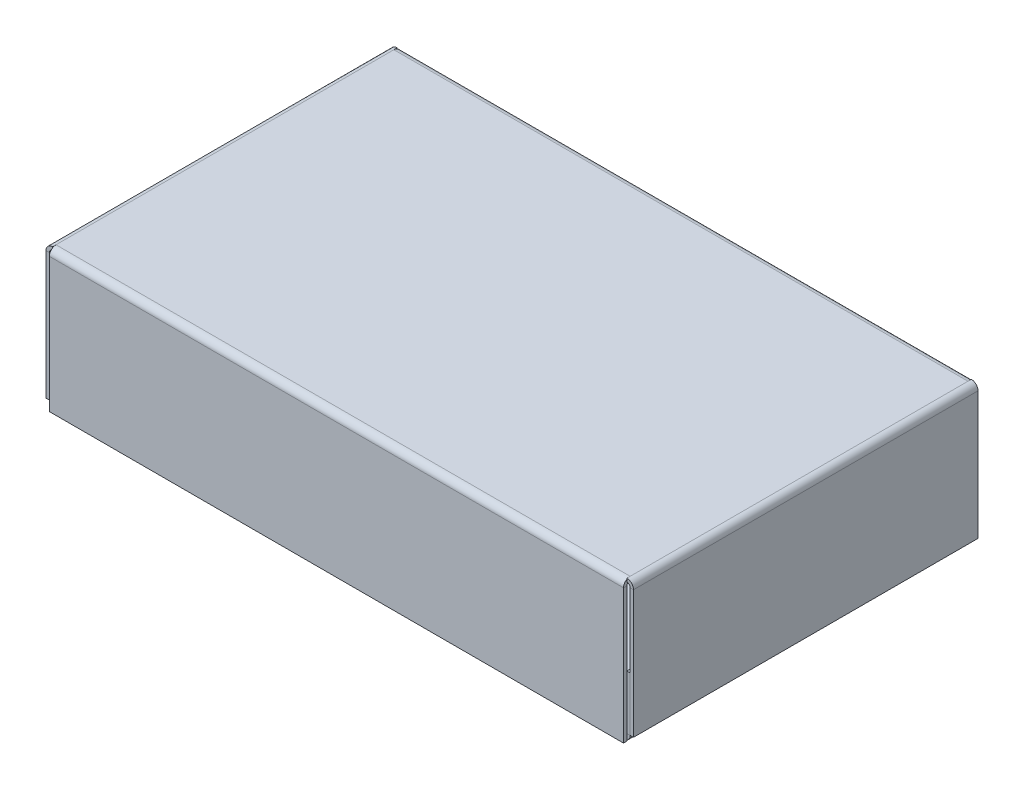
ISO-10303-21;
HEADER;
FILE_DESCRIPTION(('STEP AP214'),'2;1');
FILE_NAME('part.step','',(''),(''),'','','');
FILE_SCHEMA(('AUTOMOTIVE_DESIGN { 1 0 10303 214 1 1 1 1 }'));
ENDSEC;
DATA;
#1=APPLICATION_CONTEXT('core data for automotive mechanical design processes');
#2=APPLICATION_PROTOCOL_DEFINITION('international standard','automotive_design',2000,#1);
#3=PRODUCT_CONTEXT('',#1,'mechanical');
#4=PRODUCT('Part','Part','',(#3));
#5=PRODUCT_RELATED_PRODUCT_CATEGORY('part','',(#4));
#6=PRODUCT_DEFINITION_FORMATION('','',#4);
#7=PRODUCT_DEFINITION_CONTEXT('part definition',#1,'design');
#8=PRODUCT_DEFINITION('design','',#6,#7);
#9=PRODUCT_DEFINITION_SHAPE('','',#8);
#10=(LENGTH_UNIT() NAMED_UNIT(*) SI_UNIT(.MILLI.,.METRE.));
#11=(NAMED_UNIT(*) PLANE_ANGLE_UNIT() SI_UNIT($,.RADIAN.));
#12=(NAMED_UNIT(*) SI_UNIT($,.STERADIAN.) SOLID_ANGLE_UNIT());
#13=UNCERTAINTY_MEASURE_WITH_UNIT(LENGTH_MEASURE(1.E-05),#10,'distance_accuracy_value','');
#14=(GEOMETRIC_REPRESENTATION_CONTEXT(3) GLOBAL_UNCERTAINTY_ASSIGNED_CONTEXT((#13)) GLOBAL_UNIT_ASSIGNED_CONTEXT((#10,
#11,#12)) REPRESENTATION_CONTEXT('',''));
#15=CARTESIAN_POINT('',(0.,0.,0.));
#16=DIRECTION('',(0.,0.,1.));
#17=DIRECTION('',(1.,0.,0.));
#18=AXIS2_PLACEMENT_3D('',#15,#16,#17);
#19=CARTESIAN_POINT('',(127.,29.7434000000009,0.));
#20=DIRECTION('',(-1.,0.,1.88403309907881E-13));
#21=DIRECTION('',(1.88403309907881E-13,0.,1.));
#22=AXIS2_PLACEMENT_3D('',#19,#20,#21);
#23=PLANE('',#22);
#24=DIRECTION('',(0.,1.,0.));
#25=VECTOR('',#24,1.);
#26=CARTESIAN_POINT('',(127.,29.7434000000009,0.));
#27=LINE('',#26,#25);
#28=CARTESIAN_POINT('',(127.,30.2826286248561,0.));
#29=VERTEX_POINT('',#28);
#30=CARTESIAN_POINT('',(127.,30.4800000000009,0.));
#31=VERTEX_POINT('',#30);
#32=EDGE_CURVE('E62',#29,#31,#27,.T.);
#33=ORIENTED_EDGE('',*,*,#32,.F.);
#34=CARTESIAN_POINT('',(127.,29.0068000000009,0.736599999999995));
#35=DIRECTION('',(1.,0.,0.));
#36=DIRECTION('',(0.,1.,0.));
#37=AXIS2_PLACEMENT_3D('',#34,#35,#36);
#38=CIRCLE('',#37,1.4732);
#39=CARTESIAN_POINT('',(127.,30.4800000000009,0.73659999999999));
#40=VERTEX_POINT('',#39);
#41=EDGE_CURVE('E12',#29,#40,#38,.T.);
#42=ORIENTED_EDGE('',*,*,#41,.T.);
#43=DIRECTION('',(0.,0.,1.));
#44=VECTOR('',#43,1.);
#45=CARTESIAN_POINT('',(127.,30.4800000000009,76.2));
#46=LINE('',#45,#44);
#47=EDGE_CURVE('E347',#31,#40,#46,.T.);
#48=ORIENTED_EDGE('',*,*,#47,.F.);
#49=EDGE_LOOP('',(#33,#42,#48));
#50=FACE_BOUND('',#49,.T.);
#51=ADVANCED_FACE('F45',(#50),#23,.T.);
#52=CARTESIAN_POINT('',(0.,29.7434,0.736599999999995));
#53=DIRECTION('',(1.,0.,0.));
#54=DIRECTION('',(0.,1.,0.));
#55=AXIS2_PLACEMENT_3D('',#52,#53,#54);
#56=PLANE('',#55);
#57=DIRECTION('',(0.,0.,1.));
#58=VECTOR('',#57,1.);
#59=CARTESIAN_POINT('',(0.,30.48,76.2));
#60=LINE('',#59,#58);
#61=CARTESIAN_POINT('',(0.,30.4800000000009,0.));
#62=VERTEX_POINT('',#61);
#63=CARTESIAN_POINT('',(0.,30.48,0.73659999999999));
#64=VERTEX_POINT('',#63);
#65=EDGE_CURVE('E370',#62,#64,#60,.T.);
#66=ORIENTED_EDGE('',*,*,#65,.T.);
#67=CARTESIAN_POINT('',(0.,29.0068,0.736599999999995));
#68=DIRECTION('',(1.,0.,0.));
#69=DIRECTION('',(0.,1.,0.));
#70=AXIS2_PLACEMENT_3D('',#67,#68,#69);
#71=CIRCLE('',#70,1.4732);
#72=CARTESIAN_POINT('',(0.,30.2826286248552,0.));
#73=VERTEX_POINT('',#72);
#74=EDGE_CURVE('E274',#64,#73,#71,.F.);
#75=ORIENTED_EDGE('',*,*,#74,.T.);
#76=DIRECTION('',(0.,1.,0.));
#77=VECTOR('',#76,1.);
#78=CARTESIAN_POINT('',(0.,29.7434,0.));
#79=LINE('',#78,#77);
#80=EDGE_CURVE('E359',#73,#62,#79,.T.);
#81=ORIENTED_EDGE('',*,*,#80,.T.);
#82=EDGE_LOOP('',(#66,#75,#81));
#83=FACE_BOUND('',#82,.T.);
#84=ADVANCED_FACE('F496',(#83),#56,.T.);
#85=CARTESIAN_POINT('',(0.,29.7434,76.2));
#86=DIRECTION('',(1.,0.,0.));
#87=DIRECTION('',(0.,1.,0.));
#88=AXIS2_PLACEMENT_3D('',#85,#86,#87);
#89=PLANE('',#88);
#90=DIRECTION('',(0.,1.,0.));
#91=VECTOR('',#90,1.);
#92=CARTESIAN_POINT('',(0.,29.7434,76.2));
#93=LINE('',#92,#91);
#94=CARTESIAN_POINT('',(0.,30.2826286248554,76.2));
#95=VERTEX_POINT('',#94);
#96=CARTESIAN_POINT('',(0.,30.48,76.2));
#97=VERTEX_POINT('',#96);
#98=EDGE_CURVE('E70',#95,#97,#93,.T.);
#99=ORIENTED_EDGE('',*,*,#98,.F.);
#100=CARTESIAN_POINT('',(0.,29.0068000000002,75.4634));
#101=DIRECTION('',(-1.,0.,0.));
#102=DIRECTION('',(0.,-1.,0.));
#103=AXIS2_PLACEMENT_3D('',#100,#101,#102);
#104=CIRCLE('',#103,1.4732);
#105=CARTESIAN_POINT('',(0.,30.48,75.4634));
#106=VERTEX_POINT('',#105);
#107=EDGE_CURVE('E54',#95,#106,#104,.T.);
#108=ORIENTED_EDGE('',*,*,#107,.T.);
#109=DIRECTION('',(0.,0.,-1.));
#110=VECTOR('',#109,1.);
#111=CARTESIAN_POINT('',(0.,30.48,76.2));
#112=LINE('',#111,#110);
#113=EDGE_CURVE('E343',#97,#106,#112,.T.);
#114=ORIENTED_EDGE('',*,*,#113,.F.);
#115=EDGE_LOOP('',(#99,#108,#114));
#116=FACE_BOUND('',#115,.T.);
#117=ADVANCED_FACE('F462',(#116),#89,.T.);
#118=CARTESIAN_POINT('',(127.,29.7434000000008,75.4634));
#119=DIRECTION('',(-1.,0.,0.));
#120=DIRECTION('',(0.,-1.,0.));
#121=AXIS2_PLACEMENT_3D('',#118,#119,#120);
#122=PLANE('',#121);
#123=DIRECTION('',(0.,0.,1.));
#124=VECTOR('',#123,1.);
#125=CARTESIAN_POINT('',(127.,30.4800000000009,76.2));
#126=LINE('',#125,#124);
#127=CARTESIAN_POINT('',(127.,30.4800000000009,75.4634));
#128=VERTEX_POINT('',#127);
#129=CARTESIAN_POINT('',(127.,30.4800000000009,76.2));
#130=VERTEX_POINT('',#129);
#131=EDGE_CURVE('E338',#128,#130,#126,.T.);
#132=ORIENTED_EDGE('',*,*,#131,.F.);
#133=CARTESIAN_POINT('',(127.,29.0068000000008,75.4634));
#134=DIRECTION('',(-1.,0.,0.));
#135=DIRECTION('',(0.,-1.,0.));
#136=AXIS2_PLACEMENT_3D('',#133,#134,#135);
#137=CIRCLE('',#136,1.4732);
#138=CARTESIAN_POINT('',(127.,30.282628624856,76.2));
#139=VERTEX_POINT('',#138);
#140=EDGE_CURVE('E321',#128,#139,#137,.F.);
#141=ORIENTED_EDGE('',*,*,#140,.T.);
#142=DIRECTION('',(0.,1.,0.));
#143=VECTOR('',#142,1.);
#144=CARTESIAN_POINT('',(127.,29.7434000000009,76.2));
#145=LINE('',#144,#143);
#146=EDGE_CURVE('E355',#139,#130,#145,.T.);
#147=ORIENTED_EDGE('',*,*,#146,.T.);
#148=EDGE_LOOP('',(#132,#141,#147));
#149=FACE_BOUND('',#148,.T.);
#150=ADVANCED_FACE('F480',(#149),#122,.T.);
#151=CARTESIAN_POINT('',(-0.736600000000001,30.48,76.2));
#152=DIRECTION('',(0.,1.,0.));
#153=DIRECTION('',(-1.,0.,0.));
#154=AXIS2_PLACEMENT_3D('',#151,#152,#153);
#155=PLANE('',#154);
#156=EDGE_CURVE('E346',#40,#128,#46,.T.);
#157=ORIENTED_EDGE('',*,*,#156,.F.);
#158=DIRECTION('',(1.,0.,0.));
#159=VECTOR('',#158,1.);
#160=CARTESIAN_POINT('',(127.,30.4800000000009,0.736599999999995));
#161=LINE('',#160,#159);
#162=EDGE_CURVE('E230',#40,#64,#161,.F.);
#163=ORIENTED_EDGE('',*,*,#162,.T.);
#164=EDGE_CURVE('E366',#64,#106,#60,.T.);
#165=ORIENTED_EDGE('',*,*,#164,.T.);
#166=DIRECTION('',(-1.,0.,0.));
#167=VECTOR('',#166,1.);
#168=CARTESIAN_POINT('',(0.,30.4800000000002,75.4634));
#169=LINE('',#168,#167);
#170=EDGE_CURVE('E316',#106,#128,#169,.F.);
#171=ORIENTED_EDGE('',*,*,#170,.T.);
#172=EDGE_LOOP('',(#157,#163,#165,#171));
#173=FACE_BOUND('',#172,.T.);
#174=ADVANCED_FACE('F468',(#173),#155,.T.);
#175=CARTESIAN_POINT('',(-0.736599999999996,29.7434,76.2));
#176=DIRECTION('',(0.,1.,0.));
#177=DIRECTION('',(-1.,0.,0.));
#178=AXIS2_PLACEMENT_3D('',#175,#176,#177);
#179=PLANE('',#178);
#180=DIRECTION('',(1.,0.,0.));
#181=VECTOR('',#180,1.);
#182=CARTESIAN_POINT('',(127.,29.7434000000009,0.736599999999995));
#183=LINE('',#182,#181);
#184=CARTESIAN_POINT('',(127.,29.7434000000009,0.736599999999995));
#185=VERTEX_POINT('',#184);
#186=CARTESIAN_POINT('',(0.,29.7434,0.73659999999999));
#187=VERTEX_POINT('',#186);
#188=EDGE_CURVE('E280',#185,#187,#183,.F.);
#189=ORIENTED_EDGE('',*,*,#188,.F.);
#190=DIRECTION('',(0.,0.,1.));
#191=VECTOR('',#190,1.);
#192=CARTESIAN_POINT('',(127.,29.7434000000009,0.));
#193=LINE('',#192,#191);
#194=CARTESIAN_POINT('',(127.,29.7434000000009,75.4634));
#195=VERTEX_POINT('',#194);
#196=EDGE_CURVE('E352',#185,#195,#193,.T.);
#197=ORIENTED_EDGE('',*,*,#196,.T.);
#198=DIRECTION('',(-1.,0.,0.));
#199=VECTOR('',#198,1.);
#200=CARTESIAN_POINT('',(0.,29.7434000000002,75.4634));
#201=LINE('',#200,#199);
#202=CARTESIAN_POINT('',(0.,29.7434,75.4634));
#203=VERTEX_POINT('',#202);
#204=EDGE_CURVE('E330',#203,#195,#201,.F.);
#205=ORIENTED_EDGE('',*,*,#204,.F.);
#206=DIRECTION('',(0.,0.,1.));
#207=VECTOR('',#206,1.);
#208=CARTESIAN_POINT('',(0.,29.7434,0.));
#209=LINE('',#208,#207);
#210=EDGE_CURVE('E363',#187,#203,#209,.T.);
#211=ORIENTED_EDGE('',*,*,#210,.F.);
#212=EDGE_LOOP('',(#189,#197,#205,#211));
#213=FACE_BOUND('',#212,.T.);
#214=ADVANCED_FACE('F568',(#213),#179,.F.);
#215=CARTESIAN_POINT('',(128.4732,29.7434,0.));
#216=DIRECTION('',(0.,0.,1.));
#217=DIRECTION('',(0.,-1.,0.));
#218=AXIS2_PLACEMENT_3D('',#215,#216,#217);
#219=PLANE('',#218);
#220=DIRECTION('',(1.,0.,0.));
#221=VECTOR('',#220,1.);
#222=CARTESIAN_POINT('',(127.7366,29.0068000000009,0.));
#223=LINE('',#222,#221);
#224=CARTESIAN_POINT('',(127.7366,29.0068000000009,0.));
#225=VERTEX_POINT('',#224);
#226=CARTESIAN_POINT('',(128.4732,29.0068000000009,0.));
#227=VERTEX_POINT('',#226);
#228=EDGE_CURVE('E422',#225,#227,#223,.T.);
#229=ORIENTED_EDGE('',*,*,#228,.T.);
#230=DIRECTION('',(0.,1.,0.));
#231=VECTOR('',#230,1.);
#232=CARTESIAN_POINT('',(128.4732,29.7434,0.));
#233=LINE('',#232,#231);
#234=CARTESIAN_POINT('',(128.4732,0.7366,0.));
#235=VERTEX_POINT('',#234);
#236=EDGE_CURVE('E441',#235,#227,#233,.T.);
#237=ORIENTED_EDGE('',*,*,#236,.F.);
#238=DIRECTION('',(-1.,0.,0.));
#239=VECTOR('',#238,1.);
#240=CARTESIAN_POINT('',(128.4732,0.7366,0.));
#241=LINE('',#240,#239);
#242=CARTESIAN_POINT('',(127.7366,0.7366,0.));
#243=VERTEX_POINT('',#242);
#244=EDGE_CURVE('E49',#235,#243,#241,.T.);
#245=ORIENTED_EDGE('',*,*,#244,.T.);
#246=DIRECTION('',(0.,1.,0.));
#247=VECTOR('',#246,1.);
#248=CARTESIAN_POINT('',(127.7366,29.7434,0.));
#249=LINE('',#248,#247);
#250=EDGE_CURVE('E449',#243,#225,#249,.T.);
#251=ORIENTED_EDGE('',*,*,#250,.T.);
#252=EDGE_LOOP('',(#229,#237,#245,#251));
#253=FACE_BOUND('',#252,.T.);
#254=ADVANCED_FACE('F571',(#253),#219,.F.);
#255=CARTESIAN_POINT('',(128.4732,0.7366,76.2));
#256=DIRECTION('',(0.,0.,-1.));
#257=DIRECTION('',(-1.,0.,0.));
#258=AXIS2_PLACEMENT_3D('',#255,#256,#257);
#259=PLANE('',#258);
#260=DIRECTION('',(1.,0.,0.));
#261=VECTOR('',#260,1.);
#262=CARTESIAN_POINT('',(127.7366,29.0068000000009,76.2));
#263=LINE('',#262,#261);
#264=CARTESIAN_POINT('',(127.7366,29.0068000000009,76.2));
#265=VERTEX_POINT('',#264);
#266=CARTESIAN_POINT('',(128.4732,29.0068000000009,76.2));
#267=VERTEX_POINT('',#266);
#268=EDGE_CURVE('E432',#265,#267,#263,.T.);
#269=ORIENTED_EDGE('',*,*,#268,.F.);
#270=DIRECTION('',(0.,-1.,0.));
#271=VECTOR('',#270,1.);
#272=CARTESIAN_POINT('',(127.7366,0.7366,76.2));
#273=LINE('',#272,#271);
#274=CARTESIAN_POINT('',(127.7366,0.7366,76.2));
#275=VERTEX_POINT('',#274);
#276=EDGE_CURVE('E442',#265,#275,#273,.T.);
#277=ORIENTED_EDGE('',*,*,#276,.T.);
#278=DIRECTION('',(-1.,0.,0.));
#279=VECTOR('',#278,1.);
#280=CARTESIAN_POINT('',(128.4732,0.7366,76.2));
#281=LINE('',#280,#279);
#282=CARTESIAN_POINT('',(128.4732,0.7366,76.2));
#283=VERTEX_POINT('',#282);
#284=EDGE_CURVE('E446',#283,#275,#281,.T.);
#285=ORIENTED_EDGE('',*,*,#284,.F.);
#286=DIRECTION('',(0.,-1.,0.));
#287=VECTOR('',#286,1.);
#288=CARTESIAN_POINT('',(128.4732,0.7366,76.2));
#289=LINE('',#288,#287);
#290=EDGE_CURVE('E444',#267,#283,#289,.T.);
#291=ORIENTED_EDGE('',*,*,#290,.F.);
#292=EDGE_LOOP('',(#269,#277,#285,#291));
#293=FACE_BOUND('',#292,.T.);
#294=ADVANCED_FACE('F613',(#293),#259,.F.);
#295=CARTESIAN_POINT('',(128.4732,0.7366,76.2));
#296=DIRECTION('',(-1.,0.,0.));
#297=DIRECTION('',(0.,0.,1.));
#298=AXIS2_PLACEMENT_3D('',#295,#296,#297);
#299=PLANE('',#298);
#300=DIRECTION('',(0.,0.,-1.));
#301=VECTOR('',#300,1.);
#302=CARTESIAN_POINT('',(128.4732,29.0068000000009,0.));
#303=LINE('',#302,#301);
#304=EDGE_CURVE('E416',#227,#267,#303,.F.);
#305=ORIENTED_EDGE('',*,*,#304,.T.);
#306=ORIENTED_EDGE('',*,*,#290,.T.);
#307=DIRECTION('',(0.,0.,-1.));
#308=VECTOR('',#307,1.);
#309=CARTESIAN_POINT('',(128.4732,0.7366,0.));
#310=LINE('',#309,#308);
#311=EDGE_CURVE('E438',#283,#235,#310,.T.);
#312=ORIENTED_EDGE('',*,*,#311,.T.);
#313=ORIENTED_EDGE('',*,*,#236,.T.);
#314=EDGE_LOOP('',(#305,#306,#312,#313));
#315=FACE_BOUND('',#314,.T.);
#316=ADVANCED_FACE('F609',(#315),#299,.F.);
#317=CARTESIAN_POINT('',(127.7366,0.7366,76.2));
#318=DIRECTION('',(-1.,0.,0.));
#319=DIRECTION('',(0.,0.,1.));
#320=AXIS2_PLACEMENT_3D('',#317,#318,#319);
#321=PLANE('',#320);
#322=ORIENTED_EDGE('',*,*,#276,.F.);
#323=DIRECTION('',(0.,0.,-1.));
#324=VECTOR('',#323,1.);
#325=CARTESIAN_POINT('',(127.7366,29.0068000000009,0.));
#326=LINE('',#325,#324);
#327=EDGE_CURVE('E427',#225,#265,#326,.F.);
#328=ORIENTED_EDGE('',*,*,#327,.F.);
#329=ORIENTED_EDGE('',*,*,#250,.F.);
#330=DIRECTION('',(0.,0.,-1.));
#331=VECTOR('',#330,1.);
#332=CARTESIAN_POINT('',(127.7366,0.7366,0.));
#333=LINE('',#332,#331);
#334=EDGE_CURVE('E435',#275,#243,#333,.T.);
#335=ORIENTED_EDGE('',*,*,#334,.F.);
#336=EDGE_LOOP('',(#322,#328,#329,#335));
#337=FACE_BOUND('',#336,.T.);
#338=ADVANCED_FACE('F612',(#337),#321,.T.);
#339=CARTESIAN_POINT('',(128.4732,0.7366,0.));
#340=DIRECTION('',(0.,1.,0.));
#341=DIRECTION('',(0.,0.,1.));
#342=AXIS2_PLACEMENT_3D('',#339,#340,#341);
#343=PLANE('',#342);
#344=ORIENTED_EDGE('',*,*,#334,.T.);
#345=ORIENTED_EDGE('',*,*,#244,.F.);
#346=ORIENTED_EDGE('',*,*,#311,.F.);
#347=ORIENTED_EDGE('',*,*,#284,.T.);
#348=EDGE_LOOP('',(#344,#345,#346,#347));
#349=FACE_BOUND('',#348,.T.);
#350=ADVANCED_FACE('F47',(#349),#343,.F.);
#351=CARTESIAN_POINT('',(127.,29.0068000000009,76.2));
#352=DIRECTION('',(0.,0.,1.));
#353=DIRECTION('',(1.,0.,0.));
#354=AXIS2_PLACEMENT_3D('',#351,#352,#353);
#355=PLANE('',#354);
#356=CARTESIAN_POINT('',(127.,29.7434000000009,76.2));
#357=VERTEX_POINT('',#356);
#358=EDGE_CURVE('E356',#357,#139,#145,.T.);
#359=ORIENTED_EDGE('',*,*,#358,.F.);
#360=CARTESIAN_POINT('',(127.,29.0068000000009,76.2));
#361=DIRECTION('',(0.,0.,-1.));
#362=DIRECTION('',(-1.,0.,0.));
#363=AXIS2_PLACEMENT_3D('',#360,#361,#362);
#364=CIRCLE('',#363,0.7366);
#365=EDGE_CURVE('E425',#265,#357,#364,.F.);
#366=ORIENTED_EDGE('',*,*,#365,.F.);
#367=ORIENTED_EDGE('',*,*,#268,.T.);
#368=CARTESIAN_POINT('',(127.,29.0068000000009,76.2));
#369=DIRECTION('',(0.,0.,-1.));
#370=DIRECTION('',(-1.,0.,0.));
#371=AXIS2_PLACEMENT_3D('',#368,#369,#370);
#372=CIRCLE('',#371,1.4732);
#373=EDGE_CURVE('E418',#267,#130,#372,.F.);
#374=ORIENTED_EDGE('',*,*,#373,.T.);
#375=ORIENTED_EDGE('',*,*,#146,.F.);
#376=EDGE_LOOP('',(#359,#366,#367,#374,#375));
#377=FACE_BOUND('',#376,.T.);
#378=ADVANCED_FACE('F488',(#377),#355,.T.);
#379=CARTESIAN_POINT('',(127.,29.0068000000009,0.));
#380=DIRECTION('',(0.,0.,1.));
#381=DIRECTION('',(1.,0.,0.));
#382=AXIS2_PLACEMENT_3D('',#379,#380,#381);
#383=PLANE('',#382);
#384=CARTESIAN_POINT('',(127.,29.0068000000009,0.));
#385=DIRECTION('',(0.,0.,-1.));
#386=DIRECTION('',(-1.,0.,0.));
#387=AXIS2_PLACEMENT_3D('',#384,#385,#386);
#388=CIRCLE('',#387,0.7366);
#389=CARTESIAN_POINT('',(127.,29.7434000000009,0.));
#390=VERTEX_POINT('',#389);
#391=EDGE_CURVE('E415',#390,#225,#388,.T.);
#392=ORIENTED_EDGE('',*,*,#391,.F.);
#393=EDGE_CURVE('E350',#390,#29,#27,.T.);
#394=ORIENTED_EDGE('',*,*,#393,.T.);
#395=ORIENTED_EDGE('',*,*,#32,.T.);
#396=CARTESIAN_POINT('',(127.,29.0068000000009,0.));
#397=DIRECTION('',(0.,0.,-1.));
#398=DIRECTION('',(-1.,0.,0.));
#399=AXIS2_PLACEMENT_3D('',#396,#397,#398);
#400=CIRCLE('',#399,1.4732);
#401=EDGE_CURVE('E419',#31,#227,#400,.T.);
#402=ORIENTED_EDGE('',*,*,#401,.T.);
#403=ORIENTED_EDGE('',*,*,#228,.F.);
#404=EDGE_LOOP('',(#392,#394,#395,#402,#403));
#405=FACE_BOUND('',#404,.T.);
#406=ADVANCED_FACE('F600',(#405),#383,.F.);
#407=CARTESIAN_POINT('',(127.,29.0068000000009,0.));
#408=DIRECTION('',(0.,0.,-1.));
#409=DIRECTION('',(0.,1.,0.));
#410=AXIS2_PLACEMENT_3D('',#407,#408,#409);
#411=CYLINDRICAL_SURFACE('',#410,1.4732);
#412=ORIENTED_EDGE('',*,*,#304,.F.);
#413=ORIENTED_EDGE('',*,*,#401,.F.);
#414=ORIENTED_EDGE('',*,*,#47,.T.);
#415=ORIENTED_EDGE('',*,*,#156,.T.);
#416=ORIENTED_EDGE('',*,*,#131,.T.);
#417=ORIENTED_EDGE('',*,*,#373,.F.);
#418=EDGE_LOOP('',(#412,#413,#414,#415,#416,#417));
#419=FACE_BOUND('',#418,.T.);
#420=ADVANCED_FACE('F492',(#419),#411,.T.);
#421=CARTESIAN_POINT('',(127.,29.0068000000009,0.));
#422=DIRECTION('',(0.,0.,-1.));
#423=DIRECTION('',(0.,1.,0.));
#424=AXIS2_PLACEMENT_3D('',#421,#422,#423);
#425=CYLINDRICAL_SURFACE('',#424,0.7366);
#426=ORIENTED_EDGE('',*,*,#327,.T.);
#427=ORIENTED_EDGE('',*,*,#365,.T.);
#428=DIRECTION('',(0.,1.88403309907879E-13,1.));
#429=VECTOR('',#428,1.);
#430=CARTESIAN_POINT('',(127.,29.7434000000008,75.4634));
#431=LINE('',#430,#429);
#432=EDGE_CURVE('E324',#195,#357,#431,.T.);
#433=ORIENTED_EDGE('',*,*,#432,.F.);
#434=ORIENTED_EDGE('',*,*,#196,.F.);
#435=EDGE_CURVE('E353',#390,#185,#193,.T.);
#436=ORIENTED_EDGE('',*,*,#435,.F.);
#437=ORIENTED_EDGE('',*,*,#391,.T.);
#438=EDGE_LOOP('',(#426,#427,#433,#434,#436,#437));
#439=FACE_BOUND('',#438,.T.);
#440=ADVANCED_FACE('F596',(#439),#425,.F.);
#441=CARTESIAN_POINT('',(-1.4732,0.736600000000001,0.));
#442=DIRECTION('',(0.,0.,1.));
#443=DIRECTION('',(1.,0.,0.));
#444=AXIS2_PLACEMENT_3D('',#441,#442,#443);
#445=PLANE('',#444);
#446=DIRECTION('',(-1.,0.,0.));
#447=VECTOR('',#446,1.);
#448=CARTESIAN_POINT('',(-0.736599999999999,29.0068,0.));
#449=LINE('',#448,#447);
#450=CARTESIAN_POINT('',(-0.736599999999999,29.0068,0.));
#451=VERTEX_POINT('',#450);
#452=CARTESIAN_POINT('',(-1.4732,29.0068,0.));
#453=VERTEX_POINT('',#452);
#454=EDGE_CURVE('E391',#451,#453,#449,.T.);
#455=ORIENTED_EDGE('',*,*,#454,.F.);
#456=DIRECTION('',(0.,-1.,0.));
#457=VECTOR('',#456,1.);
#458=CARTESIAN_POINT('',(-0.7366,0.7366,0.));
#459=LINE('',#458,#457);
#460=CARTESIAN_POINT('',(-0.7366,0.7366,0.));
#461=VERTEX_POINT('',#460);
#462=EDGE_CURVE('E394',#451,#461,#459,.T.);
#463=ORIENTED_EDGE('',*,*,#462,.T.);
#464=DIRECTION('',(1.,0.,0.));
#465=VECTOR('',#464,1.);
#466=CARTESIAN_POINT('',(-1.4732,0.736600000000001,0.));
#467=LINE('',#466,#465);
#468=CARTESIAN_POINT('',(-1.4732,0.736600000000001,0.));
#469=VERTEX_POINT('',#468);
#470=EDGE_CURVE('E412',#469,#461,#467,.T.);
#471=ORIENTED_EDGE('',*,*,#470,.F.);
#472=DIRECTION('',(0.,-1.,0.));
#473=VECTOR('',#472,1.);
#474=CARTESIAN_POINT('',(-1.4732,0.736600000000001,0.));
#475=LINE('',#474,#473);
#476=EDGE_CURVE('E397',#453,#469,#475,.T.);
#477=ORIENTED_EDGE('',*,*,#476,.F.);
#478=EDGE_LOOP('',(#455,#463,#471,#477));
#479=FACE_BOUND('',#478,.T.);
#480=ADVANCED_FACE('F590',(#479),#445,.F.);
#481=CARTESIAN_POINT('',(-1.4732,0.736600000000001,76.2));
#482=DIRECTION('',(0.,0.,-1.));
#483=DIRECTION('',(-1.,0.,0.));
#484=AXIS2_PLACEMENT_3D('',#481,#482,#483);
#485=PLANE('',#484);
#486=DIRECTION('',(-1.,0.,0.));
#487=VECTOR('',#486,1.);
#488=CARTESIAN_POINT('',(-0.736599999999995,29.0068,76.2));
#489=LINE('',#488,#487);
#490=CARTESIAN_POINT('',(-0.736599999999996,29.0068,76.2));
#491=VERTEX_POINT('',#490);
#492=CARTESIAN_POINT('',(-1.4732,29.0068,76.2));
#493=VERTEX_POINT('',#492);
#494=EDGE_CURVE('E380',#491,#493,#489,.T.);
#495=ORIENTED_EDGE('',*,*,#494,.T.);
#496=DIRECTION('',(0.,1.,0.));
#497=VECTOR('',#496,1.);
#498=CARTESIAN_POINT('',(-1.4732,0.736600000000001,76.2));
#499=LINE('',#498,#497);
#500=CARTESIAN_POINT('',(-1.4732,0.736600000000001,76.2));
#501=VERTEX_POINT('',#500);
#502=EDGE_CURVE('E402',#501,#493,#499,.T.);
#503=ORIENTED_EDGE('',*,*,#502,.F.);
#504=DIRECTION('',(1.,0.,0.));
#505=VECTOR('',#504,1.);
#506=CARTESIAN_POINT('',(-1.4732,0.736600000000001,76.2));
#507=LINE('',#506,#505);
#508=CARTESIAN_POINT('',(-0.7366,0.7366,76.2));
#509=VERTEX_POINT('',#508);
#510=EDGE_CURVE('E404',#501,#509,#507,.T.);
#511=ORIENTED_EDGE('',*,*,#510,.T.);
#512=DIRECTION('',(0.,1.,0.));
#513=VECTOR('',#512,1.);
#514=CARTESIAN_POINT('',(-0.7366,0.7366,76.2));
#515=LINE('',#514,#513);
#516=EDGE_CURVE('E400',#509,#491,#515,.T.);
#517=ORIENTED_EDGE('',*,*,#516,.T.);
#518=EDGE_LOOP('',(#495,#503,#511,#517));
#519=FACE_BOUND('',#518,.T.);
#520=ADVANCED_FACE('F514',(#519),#485,.F.);
#521=CARTESIAN_POINT('',(-1.4732,29.7434,0.));
#522=DIRECTION('',(1.,0.,0.));
#523=DIRECTION('',(0.,1.,0.));
#524=AXIS2_PLACEMENT_3D('',#521,#522,#523);
#525=PLANE('',#524);
#526=DIRECTION('',(0.,0.,1.));
#527=VECTOR('',#526,1.);
#528=CARTESIAN_POINT('',(-1.4732,29.0068,76.2));
#529=LINE('',#528,#527);
#530=EDGE_CURVE('E374',#493,#453,#529,.F.);
#531=ORIENTED_EDGE('',*,*,#530,.T.);
#532=ORIENTED_EDGE('',*,*,#476,.T.);
#533=DIRECTION('',(0.,0.,1.));
#534=VECTOR('',#533,1.);
#535=CARTESIAN_POINT('',(-1.4732,0.736600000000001,0.));
#536=LINE('',#535,#534);
#537=EDGE_CURVE('E399',#469,#501,#536,.T.);
#538=ORIENTED_EDGE('',*,*,#537,.T.);
#539=ORIENTED_EDGE('',*,*,#502,.T.);
#540=EDGE_LOOP('',(#531,#532,#538,#539));
#541=FACE_BOUND('',#540,.T.);
#542=ADVANCED_FACE('F582',(#541),#525,.F.);
#543=CARTESIAN_POINT('',(-0.736599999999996,29.7434,0.));
#544=DIRECTION('',(1.,0.,0.));
#545=DIRECTION('',(0.,1.,0.));
#546=AXIS2_PLACEMENT_3D('',#543,#544,#545);
#547=PLANE('',#546);
#548=ORIENTED_EDGE('',*,*,#462,.F.);
#549=DIRECTION('',(0.,0.,1.));
#550=VECTOR('',#549,1.);
#551=CARTESIAN_POINT('',(-0.736599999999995,29.0068,76.2));
#552=LINE('',#551,#550);
#553=EDGE_CURVE('E386',#491,#451,#552,.F.);
#554=ORIENTED_EDGE('',*,*,#553,.F.);
#555=ORIENTED_EDGE('',*,*,#516,.F.);
#556=DIRECTION('',(0.,0.,1.));
#557=VECTOR('',#556,1.);
#558=CARTESIAN_POINT('',(-0.7366,0.7366,0.));
#559=LINE('',#558,#557);
#560=EDGE_CURVE('E406',#461,#509,#559,.T.);
#561=ORIENTED_EDGE('',*,*,#560,.F.);
#562=EDGE_LOOP('',(#548,#554,#555,#561));
#563=FACE_BOUND('',#562,.T.);
#564=ADVANCED_FACE('F510',(#563),#547,.T.);
#565=CARTESIAN_POINT('',(-1.4732,0.736600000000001,0.));
#566=DIRECTION('',(0.,1.,0.));
#567=DIRECTION('',(-1.,0.,0.));
#568=AXIS2_PLACEMENT_3D('',#565,#566,#567);
#569=PLANE('',#568);
#570=ORIENTED_EDGE('',*,*,#560,.T.);
#571=ORIENTED_EDGE('',*,*,#510,.F.);
#572=ORIENTED_EDGE('',*,*,#537,.F.);
#573=ORIENTED_EDGE('',*,*,#470,.T.);
#574=EDGE_LOOP('',(#570,#571,#572,#573));
#575=FACE_BOUND('',#574,.T.);
#576=ADVANCED_FACE('F579',(#575),#569,.F.);
#577=CARTESIAN_POINT('',(0.,29.0068,0.));
#578=DIRECTION('',(0.,0.,-1.));
#579=DIRECTION('',(-1.,0.,0.));
#580=AXIS2_PLACEMENT_3D('',#577,#578,#579);
#581=PLANE('',#580);
#582=CARTESIAN_POINT('',(0.,29.7434,0.));
#583=VERTEX_POINT('',#582);
#584=EDGE_CURVE('E367',#583,#73,#79,.T.);
#585=ORIENTED_EDGE('',*,*,#584,.F.);
#586=CARTESIAN_POINT('',(0.,29.0068,0.));
#587=DIRECTION('',(0.,0.,1.));
#588=DIRECTION('',(1.,0.,0.));
#589=AXIS2_PLACEMENT_3D('',#586,#587,#588);
#590=CIRCLE('',#589,0.7366);
#591=EDGE_CURVE('E383',#451,#583,#590,.F.);
#592=ORIENTED_EDGE('',*,*,#591,.F.);
#593=ORIENTED_EDGE('',*,*,#454,.T.);
#594=CARTESIAN_POINT('',(0.,29.0068,0.));
#595=DIRECTION('',(0.,0.,1.));
#596=DIRECTION('',(1.,0.,0.));
#597=AXIS2_PLACEMENT_3D('',#594,#595,#596);
#598=CIRCLE('',#597,1.4732);
#599=EDGE_CURVE('E376',#453,#62,#598,.F.);
#600=ORIENTED_EDGE('',*,*,#599,.T.);
#601=ORIENTED_EDGE('',*,*,#80,.F.);
#602=EDGE_LOOP('',(#585,#592,#593,#600,#601));
#603=FACE_BOUND('',#602,.T.);
#604=ADVANCED_FACE('F503',(#603),#581,.T.);
#605=CARTESIAN_POINT('',(0.,29.0068,76.2));
#606=DIRECTION('',(0.,0.,-1.));
#607=DIRECTION('',(-1.,0.,0.));
#608=AXIS2_PLACEMENT_3D('',#605,#606,#607);
#609=PLANE('',#608);
#610=CARTESIAN_POINT('',(0.,29.0068,76.2));
#611=DIRECTION('',(0.,0.,1.));
#612=DIRECTION('',(1.,0.,0.));
#613=AXIS2_PLACEMENT_3D('',#610,#611,#612);
#614=CIRCLE('',#613,0.7366);
#615=CARTESIAN_POINT('',(0.,29.7434,76.2));
#616=VERTEX_POINT('',#615);
#617=EDGE_CURVE('E373',#616,#491,#614,.T.);
#618=ORIENTED_EDGE('',*,*,#617,.F.);
#619=EDGE_CURVE('E364',#616,#95,#93,.T.);
#620=ORIENTED_EDGE('',*,*,#619,.T.);
#621=ORIENTED_EDGE('',*,*,#98,.T.);
#622=CARTESIAN_POINT('',(0.,29.0068,76.2));
#623=DIRECTION('',(0.,0.,1.));
#624=DIRECTION('',(1.,0.,0.));
#625=AXIS2_PLACEMENT_3D('',#622,#623,#624);
#626=CIRCLE('',#625,1.4732);
#627=EDGE_CURVE('E377',#97,#493,#626,.T.);
#628=ORIENTED_EDGE('',*,*,#627,.T.);
#629=ORIENTED_EDGE('',*,*,#494,.F.);
#630=EDGE_LOOP('',(#618,#620,#621,#628,#629));
#631=FACE_BOUND('',#630,.T.);
#632=ADVANCED_FACE('F518',(#631),#609,.F.);
#633=CARTESIAN_POINT('',(0.,29.0068,76.2));
#634=DIRECTION('',(0.,0.,1.));
#635=DIRECTION('',(0.,1.,0.));
#636=AXIS2_PLACEMENT_3D('',#633,#634,#635);
#637=CYLINDRICAL_SURFACE('',#636,1.4732);
#638=ORIENTED_EDGE('',*,*,#530,.F.);
#639=ORIENTED_EDGE('',*,*,#627,.F.);
#640=ORIENTED_EDGE('',*,*,#113,.T.);
#641=ORIENTED_EDGE('',*,*,#164,.F.);
#642=ORIENTED_EDGE('',*,*,#65,.F.);
#643=ORIENTED_EDGE('',*,*,#599,.F.);
#644=EDGE_LOOP('',(#638,#639,#640,#641,#642,#643));
#645=FACE_BOUND('',#644,.T.);
#646=ADVANCED_FACE('F474',(#645),#637,.T.);
#647=CARTESIAN_POINT('',(0.,29.0068,76.2));
#648=DIRECTION('',(0.,0.,1.));
#649=DIRECTION('',(0.,1.,0.));
#650=AXIS2_PLACEMENT_3D('',#647,#648,#649);
#651=CYLINDRICAL_SURFACE('',#650,0.7366);
#652=ORIENTED_EDGE('',*,*,#553,.T.);
#653=ORIENTED_EDGE('',*,*,#591,.T.);
#654=EDGE_CURVE('E360',#583,#187,#209,.T.);
#655=ORIENTED_EDGE('',*,*,#654,.T.);
#656=ORIENTED_EDGE('',*,*,#210,.T.);
#657=DIRECTION('',(0.,1.97823475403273E-13,-1.));
#658=VECTOR('',#657,1.);
#659=CARTESIAN_POINT('',(0.,29.7434,76.2));
#660=LINE('',#659,#658);
#661=EDGE_CURVE('E335',#616,#203,#660,.T.);
#662=ORIENTED_EDGE('',*,*,#661,.F.);
#663=ORIENTED_EDGE('',*,*,#617,.T.);
#664=EDGE_LOOP('',(#652,#653,#655,#656,#662,#663));
#665=FACE_BOUND('',#664,.T.);
#666=ADVANCED_FACE('F505',(#665),#651,.F.);
#667=CARTESIAN_POINT('',(0.,29.0068000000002,75.4634));
#668=DIRECTION('',(1.,0.,0.));
#669=DIRECTION('',(0.,1.,0.));
#670=AXIS2_PLACEMENT_3D('',#667,#668,#669);
#671=PLANE('',#670);
#672=ORIENTED_EDGE('',*,*,#619,.F.);
#673=ORIENTED_EDGE('',*,*,#661,.T.);
#674=CARTESIAN_POINT('',(0.,29.0068000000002,75.4634));
#675=DIRECTION('',(-1.,0.,0.));
#676=DIRECTION('',(0.,-1.,0.));
#677=AXIS2_PLACEMENT_3D('',#674,#675,#676);
#678=CIRCLE('',#677,0.736600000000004);
#679=CARTESIAN_POINT('',(0.,29.0068000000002,76.2));
#680=VERTEX_POINT('',#679);
#681=EDGE_CURVE('E313',#680,#203,#678,.T.);
#682=ORIENTED_EDGE('',*,*,#681,.F.);
#683=DIRECTION('',(0.,0.,1.));
#684=VECTOR('',#683,1.);
#685=CARTESIAN_POINT('',(0.,29.0068,76.2));
#686=LINE('',#685,#684);
#687=CARTESIAN_POINT('',(0.,29.0068000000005,76.9366));
#688=VERTEX_POINT('',#687);
#689=EDGE_CURVE('E286',#680,#688,#686,.T.);
#690=ORIENTED_EDGE('',*,*,#689,.T.);
#691=EDGE_CURVE('E320',#688,#95,#104,.T.);
#692=ORIENTED_EDGE('',*,*,#691,.T.);
#693=EDGE_LOOP('',(#672,#673,#682,#690,#692));
#694=FACE_BOUND('',#693,.T.);
#695=ADVANCED_FACE('F521',(#694),#671,.F.);
#696=CARTESIAN_POINT('',(127.,29.0068000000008,75.4634));
#697=DIRECTION('',(1.,0.,0.));
#698=DIRECTION('',(0.,1.,0.));
#699=AXIS2_PLACEMENT_3D('',#696,#697,#698);
#700=PLANE('',#699);
#701=CARTESIAN_POINT('',(127.,29.0068000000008,75.4634));
#702=DIRECTION('',(-1.,0.,0.));
#703=DIRECTION('',(0.,-1.,0.));
#704=AXIS2_PLACEMENT_3D('',#701,#702,#703);
#705=CIRCLE('',#704,0.736600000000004);
#706=CARTESIAN_POINT('',(127.,29.0068000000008,76.2));
#707=VERTEX_POINT('',#706);
#708=EDGE_CURVE('E327',#195,#707,#705,.F.);
#709=ORIENTED_EDGE('',*,*,#708,.F.);
#710=ORIENTED_EDGE('',*,*,#432,.T.);
#711=ORIENTED_EDGE('',*,*,#358,.T.);
#712=CARTESIAN_POINT('',(127.,29.0068000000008,76.9366));
#713=VERTEX_POINT('',#712);
#714=EDGE_CURVE('E319',#139,#713,#137,.F.);
#715=ORIENTED_EDGE('',*,*,#714,.T.);
#716=DIRECTION('',(0.,0.,1.));
#717=VECTOR('',#716,1.);
#718=CARTESIAN_POINT('',(127.,29.0068000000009,76.2));
#719=LINE('',#718,#717);
#720=EDGE_CURVE('E276',#707,#713,#719,.T.);
#721=ORIENTED_EDGE('',*,*,#720,.F.);
#722=EDGE_LOOP('',(#709,#710,#711,#715,#721));
#723=FACE_BOUND('',#722,.T.);
#724=ADVANCED_FACE('F484',(#723),#700,.T.);
#725=CARTESIAN_POINT('',(0.,29.0068000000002,75.4634));
#726=DIRECTION('',(-1.,0.,0.));
#727=DIRECTION('',(0.,0.,1.));
#728=AXIS2_PLACEMENT_3D('',#725,#726,#727);
#729=CYLINDRICAL_SURFACE('',#728,1.4732);
#730=ORIENTED_EDGE('',*,*,#170,.F.);
#731=ORIENTED_EDGE('',*,*,#107,.F.);
#732=ORIENTED_EDGE('',*,*,#691,.F.);
#733=DIRECTION('',(-1.,0.,0.));
#734=VECTOR('',#733,1.);
#735=CARTESIAN_POINT('',(0.,29.0068,76.9366));
#736=LINE('',#735,#734);
#737=EDGE_CURVE('E289',#713,#688,#736,.T.);
#738=ORIENTED_EDGE('',*,*,#737,.F.);
#739=ORIENTED_EDGE('',*,*,#714,.F.);
#740=ORIENTED_EDGE('',*,*,#140,.F.);
#741=EDGE_LOOP('',(#730,#731,#732,#738,#739,#740));
#742=FACE_BOUND('',#741,.T.);
#743=ADVANCED_FACE('F476',(#742),#729,.T.);
#744=CARTESIAN_POINT('',(0.,29.0068000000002,75.4634));
#745=DIRECTION('',(-1.,0.,0.));
#746=DIRECTION('',(0.,0.,1.));
#747=AXIS2_PLACEMENT_3D('',#744,#745,#746);
#748=CYLINDRICAL_SURFACE('',#747,0.736600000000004);
#749=ORIENTED_EDGE('',*,*,#204,.T.);
#750=ORIENTED_EDGE('',*,*,#708,.T.);
#751=DIRECTION('',(-1.,0.,0.));
#752=VECTOR('',#751,1.);
#753=CARTESIAN_POINT('',(127.,29.0068000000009,76.2));
#754=LINE('',#753,#752);
#755=EDGE_CURVE('E284',#707,#680,#754,.T.);
#756=ORIENTED_EDGE('',*,*,#755,.T.);
#757=ORIENTED_EDGE('',*,*,#681,.T.);
#758=EDGE_LOOP('',(#749,#750,#756,#757));
#759=FACE_BOUND('',#758,.T.);
#760=ADVANCED_FACE('F543',(#759),#748,.F.);
#761=CARTESIAN_POINT('',(0.,29.7434,76.9366));
#762=DIRECTION('',(-1.,0.,0.));
#763=DIRECTION('',(0.,-1.,0.));
#764=AXIS2_PLACEMENT_3D('',#761,#762,#763);
#765=PLANE('',#764);
#766=DIRECTION('',(0.,1.,0.));
#767=VECTOR('',#766,1.);
#768=CARTESIAN_POINT('',(0.,29.7434,76.9366));
#769=LINE('',#768,#767);
#770=CARTESIAN_POINT('',(0.,-0.736600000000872,76.9366000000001));
#771=VERTEX_POINT('',#770);
#772=EDGE_CURVE('E301',#771,#688,#769,.T.);
#773=ORIENTED_EDGE('',*,*,#772,.T.);
#774=ORIENTED_EDGE('',*,*,#689,.F.);
#775=DIRECTION('',(0.,1.,0.));
#776=VECTOR('',#775,1.);
#777=CARTESIAN_POINT('',(0.,29.7434,76.2));
#778=LINE('',#777,#776);
#779=CARTESIAN_POINT('',(0.,-0.736600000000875,76.2000000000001));
#780=VERTEX_POINT('',#779);
#781=EDGE_CURVE('E298',#780,#680,#778,.T.);
#782=ORIENTED_EDGE('',*,*,#781,.F.);
#783=DIRECTION('',(0.,0.,-1.));
#784=VECTOR('',#783,1.);
#785=CARTESIAN_POINT('',(0.,-0.736600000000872,76.9366000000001));
#786=LINE('',#785,#784);
#787=EDGE_CURVE('E311',#771,#780,#786,.T.);
#788=ORIENTED_EDGE('',*,*,#787,.F.);
#789=EDGE_LOOP('',(#773,#774,#782,#788));
#790=FACE_BOUND('',#789,.T.);
#791=ADVANCED_FACE('F541',(#790),#765,.T.);
#792=CARTESIAN_POINT('',(127.,-0.736599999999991,76.9366000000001));
#793=DIRECTION('',(1.,0.,0.));
#794=DIRECTION('',(0.,1.,0.));
#795=AXIS2_PLACEMENT_3D('',#792,#793,#794);
#796=PLANE('',#795);
#797=DIRECTION('',(0.,-1.,0.));
#798=VECTOR('',#797,1.);
#799=CARTESIAN_POINT('',(127.,-0.736599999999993,76.2000000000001));
#800=LINE('',#799,#798);
#801=CARTESIAN_POINT('',(127.,-0.736599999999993,76.2000000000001));
#802=VERTEX_POINT('',#801);
#803=EDGE_CURVE('E294',#707,#802,#800,.T.);
#804=ORIENTED_EDGE('',*,*,#803,.F.);
#805=ORIENTED_EDGE('',*,*,#720,.T.);
#806=DIRECTION('',(0.,-1.,0.));
#807=VECTOR('',#806,1.);
#808=CARTESIAN_POINT('',(127.,-0.736599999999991,76.9366000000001));
#809=LINE('',#808,#807);
#810=CARTESIAN_POINT('',(127.,-0.736599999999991,76.9366000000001));
#811=VERTEX_POINT('',#810);
#812=EDGE_CURVE('E295',#713,#811,#809,.T.);
#813=ORIENTED_EDGE('',*,*,#812,.T.);
#814=DIRECTION('',(0.,0.,-1.));
#815=VECTOR('',#814,1.);
#816=CARTESIAN_POINT('',(127.,-0.736599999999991,76.9366000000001));
#817=LINE('',#816,#815);
#818=EDGE_CURVE('E304',#811,#802,#817,.T.);
#819=ORIENTED_EDGE('',*,*,#818,.T.);
#820=EDGE_LOOP('',(#804,#805,#813,#819));
#821=FACE_BOUND('',#820,.T.);
#822=ADVANCED_FACE('F529',(#821),#796,.T.);
#823=CARTESIAN_POINT('',(0.,29.7434,76.9366));
#824=DIRECTION('',(0.,0.,1.));
#825=DIRECTION('',(0.,-1.,0.));
#826=AXIS2_PLACEMENT_3D('',#823,#824,#825);
#827=PLANE('',#826);
#828=ORIENTED_EDGE('',*,*,#812,.F.);
#829=ORIENTED_EDGE('',*,*,#737,.T.);
#830=ORIENTED_EDGE('',*,*,#772,.F.);
#831=DIRECTION('',(-1.,0.,0.));
#832=VECTOR('',#831,1.);
#833=CARTESIAN_POINT('',(0.,-0.736600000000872,76.9366000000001));
#834=LINE('',#833,#832);
#835=EDGE_CURVE('E297',#811,#771,#834,.T.);
#836=ORIENTED_EDGE('',*,*,#835,.F.);
#837=EDGE_LOOP('',(#828,#829,#830,#836));
#838=FACE_BOUND('',#837,.T.);
#839=ADVANCED_FACE('F532',(#838),#827,.T.);
#840=CARTESIAN_POINT('',(0.,29.7434,76.2));
#841=DIRECTION('',(0.,0.,1.));
#842=DIRECTION('',(0.,-1.,0.));
#843=AXIS2_PLACEMENT_3D('',#840,#841,#842);
#844=PLANE('',#843);
#845=ORIENTED_EDGE('',*,*,#755,.F.);
#846=ORIENTED_EDGE('',*,*,#803,.T.);
#847=DIRECTION('',(-1.,0.,0.));
#848=VECTOR('',#847,1.);
#849=CARTESIAN_POINT('',(0.,-0.736600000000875,76.2000000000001));
#850=LINE('',#849,#848);
#851=EDGE_CURVE('E306',#802,#780,#850,.T.);
#852=ORIENTED_EDGE('',*,*,#851,.T.);
#853=ORIENTED_EDGE('',*,*,#781,.T.);
#854=EDGE_LOOP('',(#845,#846,#852,#853));
#855=FACE_BOUND('',#854,.T.);
#856=ADVANCED_FACE('F539',(#855),#844,.F.);
#857=CARTESIAN_POINT('',(0.,-0.736600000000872,76.9366000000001));
#858=DIRECTION('',(0.,-1.,0.));
#859=DIRECTION('',(1.,0.,0.));
#860=AXIS2_PLACEMENT_3D('',#857,#858,#859);
#861=PLANE('',#860);
#862=ORIENTED_EDGE('',*,*,#851,.F.);
#863=ORIENTED_EDGE('',*,*,#818,.F.);
#864=ORIENTED_EDGE('',*,*,#835,.T.);
#865=ORIENTED_EDGE('',*,*,#787,.T.);
#866=EDGE_LOOP('',(#862,#863,#864,#865));
#867=FACE_BOUND('',#866,.T.);
#868=ADVANCED_FACE('F535',(#867),#861,.T.);
#869=CARTESIAN_POINT('',(127.,29.0068000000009,0.736599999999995));
#870=DIRECTION('',(-1.,0.,0.));
#871=DIRECTION('',(0.,-1.,0.));
#872=AXIS2_PLACEMENT_3D('',#869,#870,#871);
#873=PLANE('',#872);
#874=ORIENTED_EDGE('',*,*,#393,.F.);
#875=ORIENTED_EDGE('',*,*,#435,.T.);
#876=CARTESIAN_POINT('',(127.,29.0068000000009,0.736599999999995));
#877=DIRECTION('',(1.,0.,0.));
#878=DIRECTION('',(0.,1.,0.));
#879=AXIS2_PLACEMENT_3D('',#876,#877,#878);
#880=CIRCLE('',#879,0.736599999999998);
#881=CARTESIAN_POINT('',(127.,29.0068000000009,0.));
#882=VERTEX_POINT('',#881);
#883=EDGE_CURVE('E238',#882,#185,#880,.T.);
#884=ORIENTED_EDGE('',*,*,#883,.F.);
#885=DIRECTION('',(0.,0.,-1.));
#886=VECTOR('',#885,1.);
#887=CARTESIAN_POINT('',(127.,29.0068000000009,0.));
#888=LINE('',#887,#886);
#889=CARTESIAN_POINT('',(127.,29.0068000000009,-0.736600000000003));
#890=VERTEX_POINT('',#889);
#891=EDGE_CURVE('E234',#882,#890,#888,.T.);
#892=ORIENTED_EDGE('',*,*,#891,.T.);
#893=EDGE_CURVE('E56',#890,#29,#38,.T.);
#894=ORIENTED_EDGE('',*,*,#893,.T.);
#895=EDGE_LOOP('',(#874,#875,#884,#892,#894));
#896=FACE_BOUND('',#895,.T.);
#897=ADVANCED_FACE('F235',(#896),#873,.F.);
#898=CARTESIAN_POINT('',(0.,29.0068,0.736599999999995));
#899=DIRECTION('',(-1.,0.,0.));
#900=DIRECTION('',(0.,-1.,0.));
#901=AXIS2_PLACEMENT_3D('',#898,#899,#900);
#902=PLANE('',#901);
#903=ORIENTED_EDGE('',*,*,#654,.F.);
#904=ORIENTED_EDGE('',*,*,#584,.T.);
#905=CARTESIAN_POINT('',(0.,29.0068,-0.736600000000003));
#906=VERTEX_POINT('',#905);
#907=EDGE_CURVE('E273',#73,#906,#71,.F.);
#908=ORIENTED_EDGE('',*,*,#907,.T.);
#909=DIRECTION('',(0.,0.,-1.));
#910=VECTOR('',#909,1.);
#911=CARTESIAN_POINT('',(1.02279228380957E-13,29.0068,0.));
#912=LINE('',#911,#910);
#913=CARTESIAN_POINT('',(0.,29.0068,0.));
#914=VERTEX_POINT('',#913);
#915=EDGE_CURVE('E631',#914,#906,#912,.T.);
#916=ORIENTED_EDGE('',*,*,#915,.F.);
#917=CARTESIAN_POINT('',(0.,29.0068,0.736599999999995));
#918=DIRECTION('',(1.,0.,0.));
#919=DIRECTION('',(0.,1.,0.));
#920=AXIS2_PLACEMENT_3D('',#917,#918,#919);
#921=CIRCLE('',#920,0.736599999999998);
#922=EDGE_CURVE('E231',#187,#914,#921,.F.);
#923=ORIENTED_EDGE('',*,*,#922,.F.);
#924=EDGE_LOOP('',(#903,#904,#908,#916,#923));
#925=FACE_BOUND('',#924,.T.);
#926=ADVANCED_FACE('F499',(#925),#902,.T.);
#927=CARTESIAN_POINT('',(127.,29.0068000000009,0.736599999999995));
#928=DIRECTION('',(1.,0.,0.));
#929=DIRECTION('',(0.,0.,-1.));
#930=AXIS2_PLACEMENT_3D('',#927,#928,#929);
#931=CYLINDRICAL_SURFACE('',#930,1.4732);
#932=ORIENTED_EDGE('',*,*,#162,.F.);
#933=ORIENTED_EDGE('',*,*,#41,.F.);
#934=ORIENTED_EDGE('',*,*,#893,.F.);
#935=DIRECTION('',(-1.,0.,0.));
#936=VECTOR('',#935,1.);
#937=CARTESIAN_POINT('',(0.,29.0068,-0.736600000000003));
#938=LINE('',#937,#936);
#939=EDGE_CURVE('E226',#890,#906,#938,.T.);
#940=ORIENTED_EDGE('',*,*,#939,.T.);
#941=ORIENTED_EDGE('',*,*,#907,.F.);
#942=ORIENTED_EDGE('',*,*,#74,.F.);
#943=EDGE_LOOP('',(#932,#933,#934,#940,#941,#942));
#944=FACE_BOUND('',#943,.T.);
#945=ADVANCED_FACE('F223',(#944),#931,.T.);
#946=CARTESIAN_POINT('',(127.,29.0068000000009,0.736599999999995));
#947=DIRECTION('',(1.,0.,0.));
#948=DIRECTION('',(0.,0.,-1.));
#949=AXIS2_PLACEMENT_3D('',#946,#947,#948);
#950=CYLINDRICAL_SURFACE('',#949,0.736599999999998);
#951=ORIENTED_EDGE('',*,*,#188,.T.);
#952=ORIENTED_EDGE('',*,*,#922,.T.);
#953=DIRECTION('',(1.,0.,0.));
#954=VECTOR('',#953,1.);
#955=CARTESIAN_POINT('',(1.02279228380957E-13,29.0068,0.));
#956=LINE('',#955,#954);
#957=EDGE_CURVE('E243',#914,#882,#956,.T.);
#958=ORIENTED_EDGE('',*,*,#957,.T.);
#959=ORIENTED_EDGE('',*,*,#883,.T.);
#960=EDGE_LOOP('',(#951,#952,#958,#959));
#961=FACE_BOUND('',#960,.T.);
#962=ADVANCED_FACE('F627',(#961),#950,.F.);
#963=CARTESIAN_POINT('',(0.,29.7434,-0.7366));
#964=DIRECTION('',(-1.,0.,0.));
#965=DIRECTION('',(0.,-1.,0.));
#966=AXIS2_PLACEMENT_3D('',#963,#964,#965);
#967=PLANE('',#966);
#968=DIRECTION('',(0.,-1.,0.));
#969=VECTOR('',#968,1.);
#970=CARTESIAN_POINT('',(0.,29.7434,0.));
#971=LINE('',#970,#969);
#972=CARTESIAN_POINT('',(2.08028039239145E-13,-0.736600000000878,-1.06420412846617E-13));
#973=VERTEX_POINT('',#972);
#974=EDGE_CURVE('E253',#914,#973,#971,.T.);
#975=ORIENTED_EDGE('',*,*,#974,.F.);
#976=ORIENTED_EDGE('',*,*,#915,.T.);
#977=DIRECTION('',(0.,-1.,0.));
#978=VECTOR('',#977,1.);
#979=CARTESIAN_POINT('',(0.,29.7434,-0.7366));
#980=LINE('',#979,#978);
#981=CARTESIAN_POINT('',(2.08028039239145E-13,-0.736600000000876,-0.736600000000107));
#982=VERTEX_POINT('',#981);
#983=EDGE_CURVE('E252',#906,#982,#980,.T.);
#984=ORIENTED_EDGE('',*,*,#983,.T.);
#985=DIRECTION('',(0.,0.,1.));
#986=VECTOR('',#985,1.);
#987=CARTESIAN_POINT('',(2.08028039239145E-13,-0.736600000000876,-0.736600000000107));
#988=LINE('',#987,#986);
#989=EDGE_CURVE('E257',#982,#973,#988,.T.);
#990=ORIENTED_EDGE('',*,*,#989,.T.);
#991=EDGE_LOOP('',(#975,#976,#984,#990));
#992=FACE_BOUND('',#991,.T.);
#993=ADVANCED_FACE('F636',(#992),#967,.T.);
#994=CARTESIAN_POINT('',(127.,-0.736599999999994,-0.736600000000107));
#995=DIRECTION('',(1.,0.,0.));
#996=DIRECTION('',(0.,1.,0.));
#997=AXIS2_PLACEMENT_3D('',#994,#995,#996);
#998=PLANE('',#997);
#999=DIRECTION('',(0.,1.,0.));
#1000=VECTOR('',#999,1.);
#1001=CARTESIAN_POINT('',(127.,-0.736599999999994,-0.736600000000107));
#1002=LINE('',#1001,#1000);
#1003=CARTESIAN_POINT('',(127.,-0.736599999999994,-0.736600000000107));
#1004=VERTEX_POINT('',#1003);
#1005=EDGE_CURVE('E250',#1004,#890,#1002,.T.);
#1006=ORIENTED_EDGE('',*,*,#1005,.T.);
#1007=ORIENTED_EDGE('',*,*,#891,.F.);
#1008=DIRECTION('',(0.,1.,0.));
#1009=VECTOR('',#1008,1.);
#1010=CARTESIAN_POINT('',(127.,-0.736599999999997,-1.06420412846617E-13));
#1011=LINE('',#1010,#1009);
#1012=CARTESIAN_POINT('',(127.,-0.736599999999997,-1.06420412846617E-13));
#1013=VERTEX_POINT('',#1012);
#1014=EDGE_CURVE('E269',#1013,#882,#1011,.T.);
#1015=ORIENTED_EDGE('',*,*,#1014,.F.);
#1016=DIRECTION('',(0.,0.,1.));
#1017=VECTOR('',#1016,1.);
#1018=CARTESIAN_POINT('',(127.,-0.736599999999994,-0.736600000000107));
#1019=LINE('',#1018,#1017);
#1020=EDGE_CURVE('E256',#1004,#1013,#1019,.T.);
#1021=ORIENTED_EDGE('',*,*,#1020,.F.);
#1022=EDGE_LOOP('',(#1006,#1007,#1015,#1021));
#1023=FACE_BOUND('',#1022,.T.);
#1024=ADVANCED_FACE('F255',(#1023),#998,.T.);
#1025=CARTESIAN_POINT('',(2.08028039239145E-13,-0.736600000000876,-0.736600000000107));
#1026=DIRECTION('',(0.,0.,1.));
#1027=DIRECTION('',(0.,-1.,0.));
#1028=AXIS2_PLACEMENT_3D('',#1025,#1026,#1027);
#1029=PLANE('',#1028);
#1030=ORIENTED_EDGE('',*,*,#939,.F.);
#1031=ORIENTED_EDGE('',*,*,#1005,.F.);
#1032=DIRECTION('',(1.,0.,0.));
#1033=VECTOR('',#1032,1.);
#1034=CARTESIAN_POINT('',(2.08028039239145E-13,-0.736600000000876,-0.736600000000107));
#1035=LINE('',#1034,#1033);
#1036=EDGE_CURVE('E258',#982,#1004,#1035,.T.);
#1037=ORIENTED_EDGE('',*,*,#1036,.F.);
#1038=ORIENTED_EDGE('',*,*,#983,.F.);
#1039=EDGE_LOOP('',(#1030,#1031,#1037,#1038));
#1040=FACE_BOUND('',#1039,.T.);
#1041=ADVANCED_FACE('F248',(#1040),#1029,.F.);
#1042=CARTESIAN_POINT('',(2.08028039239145E-13,-0.736600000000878,-1.06420412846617E-13));
#1043=DIRECTION('',(0.,0.,1.));
#1044=DIRECTION('',(0.,-1.,0.));
#1045=AXIS2_PLACEMENT_3D('',#1042,#1043,#1044);
#1046=PLANE('',#1045);
#1047=ORIENTED_EDGE('',*,*,#1014,.T.);
#1048=ORIENTED_EDGE('',*,*,#957,.F.);
#1049=ORIENTED_EDGE('',*,*,#974,.T.);
#1050=DIRECTION('',(1.,0.,0.));
#1051=VECTOR('',#1050,1.);
#1052=CARTESIAN_POINT('',(2.08028039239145E-13,-0.736600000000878,-1.06420412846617E-13));
#1053=LINE('',#1052,#1051);
#1054=EDGE_CURVE('E266',#973,#1013,#1053,.T.);
#1055=ORIENTED_EDGE('',*,*,#1054,.T.);
#1056=EDGE_LOOP('',(#1047,#1048,#1049,#1055));
#1057=FACE_BOUND('',#1056,.T.);
#1058=ADVANCED_FACE('F640',(#1057),#1046,.T.);
#1059=CARTESIAN_POINT('',(2.08028039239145E-13,-0.736600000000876,-0.736600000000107));
#1060=DIRECTION('',(0.,-1.,0.));
#1061=DIRECTION('',(1.,0.,0.));
#1062=AXIS2_PLACEMENT_3D('',#1059,#1060,#1061);
#1063=PLANE('',#1062);
#1064=ORIENTED_EDGE('',*,*,#1054,.F.);
#1065=ORIENTED_EDGE('',*,*,#989,.F.);
#1066=ORIENTED_EDGE('',*,*,#1036,.T.);
#1067=ORIENTED_EDGE('',*,*,#1020,.T.);
#1068=EDGE_LOOP('',(#1064,#1065,#1066,#1067));
#1069=FACE_BOUND('',#1068,.T.);
#1070=ADVANCED_FACE('F639',(#1069),#1063,.T.);
#1071=CLOSED_SHELL('',(#51,#84,#117,#150,#174,#214,#254,#294,#316,#338,#350,#378,#406,#420,#440,
#480,#520,#542,#564,#576,#604,#632,#646,#666,#695,#724,#743,#760,#791,#822,#839,#856,#868,#897,
#926,#945,#962,#993,#1024,#1041,#1058,#1070));
#1072=MANIFOLD_SOLID_BREP('B2',#1071);
#1073=CARTESIAN_POINT('',(0.7366,0.,76.2));
#1074=DIRECTION('',(0.,0.,1.));
#1075=DIRECTION('',(1.,0.,0.));
#1076=AXIS2_PLACEMENT_3D('',#1073,#1074,#1075);
#1077=PLANE('',#1076);
#1078=DIRECTION('',(0.,-1.,0.));
#1079=VECTOR('',#1078,1.);
#1080=CARTESIAN_POINT('',(0.7366,0.,76.2));
#1081=LINE('',#1080,#1079);
#1082=CARTESIAN_POINT('',(0.7366,0.,76.2));
#1083=VERTEX_POINT('',#1082);
#1084=CARTESIAN_POINT('',(0.7366,-0.7366,76.2));
#1085=VERTEX_POINT('',#1084);
#1086=EDGE_CURVE('E43',#1083,#1085,#1081,.T.);
#1087=ORIENTED_EDGE('',*,*,#1086,.F.);
#1088=CARTESIAN_POINT('',(0.7366,0.7366,76.2));
#1089=DIRECTION('',(0.,0.,-1.));
#1090=DIRECTION('',(-1.,0.,0.));
#1091=AXIS2_PLACEMENT_3D('',#1088,#1089,#1090);
#1092=CIRCLE('',#1091,0.7366);
#1093=CARTESIAN_POINT('',(0.,0.7366,76.2));
#1094=VERTEX_POINT('',#1093);
#1095=EDGE_CURVE('E1219',#1094,#1083,#1092,.F.);
#1096=ORIENTED_EDGE('',*,*,#1095,.F.);
#1097=DIRECTION('',(1.,0.,0.));
#1098=VECTOR('',#1097,1.);
#1099=CARTESIAN_POINT('',(-0.7366,0.7366,76.2));
#1100=LINE('',#1099,#1098);
#1101=CARTESIAN_POINT('',(-0.7366,0.7366,76.2));
#1102=VERTEX_POINT('',#1101);
#1103=EDGE_CURVE('E1017',#1102,#1094,#1100,.T.);
#1104=ORIENTED_EDGE('',*,*,#1103,.F.);
#1105=CARTESIAN_POINT('',(0.7366,0.7366,76.2));
#1106=DIRECTION('',(0.,0.,1.));
#1107=DIRECTION('',(1.,0.,0.));
#1108=AXIS2_PLACEMENT_3D('',#1105,#1106,#1107);
#1109=CIRCLE('',#1108,1.4732);
#1110=EDGE_CURVE('E1118',#1102,#1085,#1109,.T.);
#1111=ORIENTED_EDGE('',*,*,#1110,.T.);
#1112=EDGE_LOOP('',(#1087,#1096,#1104,#1111));
#1113=FACE_BOUND('',#1112,.T.);
#1114=ADVANCED_FACE('F1009',(#1113),#1077,.T.);
#1115=CARTESIAN_POINT('',(-0.7366,0.7366,76.2));
#1116=DIRECTION('',(0.,0.,1.));
#1117=DIRECTION('',(1.,0.,0.));
#1118=AXIS2_PLACEMENT_3D('',#1115,#1116,#1117);
#1119=PLANE('',#1118);
#1120=DIRECTION('',(1.,0.,0.));
#1121=VECTOR('',#1120,1.);
#1122=CARTESIAN_POINT('',(0.,0.,76.2));
#1123=LINE('',#1122,#1121);
#1124=CARTESIAN_POINT('',(126.2634,0.,76.2));
#1125=VERTEX_POINT('',#1124);
#1126=EDGE_CURVE('E1112',#1083,#1125,#1123,.T.);
#1127=ORIENTED_EDGE('',*,*,#1126,.F.);
#1128=ORIENTED_EDGE('',*,*,#1086,.T.);
#1129=DIRECTION('',(1.,0.,0.));
#1130=VECTOR('',#1129,1.);
#1131=CARTESIAN_POINT('',(0.,-0.7366,76.2));
#1132=LINE('',#1131,#1130);
#1133=CARTESIAN_POINT('',(126.2634,-0.7366,76.2));
#1134=VERTEX_POINT('',#1133);
#1135=EDGE_CURVE('E1109',#1085,#1134,#1132,.T.);
#1136=ORIENTED_EDGE('',*,*,#1135,.T.);
#1137=DIRECTION('',(0.,1.,0.));
#1138=VECTOR('',#1137,1.);
#1139=CARTESIAN_POINT('',(126.2634,-0.7366,76.2));
#1140=LINE('',#1139,#1138);
#1141=EDGE_CURVE('E1200',#1134,#1125,#1140,.T.);
#1142=ORIENTED_EDGE('',*,*,#1141,.T.);
#1143=EDGE_LOOP('',(#1127,#1128,#1136,#1142));
#1144=FACE_BOUND('',#1143,.T.);
#1145=ADVANCED_FACE('F1107',(#1144),#1119,.T.);
#1146=CARTESIAN_POINT('',(0.,0.7366,0.));
#1147=DIRECTION('',(0.,0.,-1.));
#1148=DIRECTION('',(-1.,0.,0.));
#1149=AXIS2_PLACEMENT_3D('',#1146,#1147,#1148);
#1150=PLANE('',#1149);
#1151=DIRECTION('',(-1.,0.,0.));
#1152=VECTOR('',#1151,1.);
#1153=CARTESIAN_POINT('',(0.,0.7366,0.));
#1154=LINE('',#1153,#1152);
#1155=CARTESIAN_POINT('',(0.,0.7366,0.));
#1156=VERTEX_POINT('',#1155);
#1157=CARTESIAN_POINT('',(-0.7366,0.7366,0.));
#1158=VERTEX_POINT('',#1157);
#1159=EDGE_CURVE('E1205',#1156,#1158,#1154,.T.);
#1160=ORIENTED_EDGE('',*,*,#1159,.F.);
#1161=CARTESIAN_POINT('',(0.7366,0.7366,0.));
#1162=DIRECTION('',(0.,0.,-1.));
#1163=DIRECTION('',(-1.,0.,0.));
#1164=AXIS2_PLACEMENT_3D('',#1161,#1162,#1163);
#1165=CIRCLE('',#1164,0.7366);
#1166=CARTESIAN_POINT('',(0.7366,0.,0.));
#1167=VERTEX_POINT('',#1166);
#1168=EDGE_CURVE('E1157',#1156,#1167,#1165,.F.);
#1169=ORIENTED_EDGE('',*,*,#1168,.T.);
#1170=DIRECTION('',(0.,1.,0.));
#1171=VECTOR('',#1170,1.);
#1172=CARTESIAN_POINT('',(0.7366,-0.7366,0.));
#1173=LINE('',#1172,#1171);
#1174=CARTESIAN_POINT('',(0.7366,-0.7366,0.));
#1175=VERTEX_POINT('',#1174);
#1176=EDGE_CURVE('E1203',#1175,#1167,#1173,.T.);
#1177=ORIENTED_EDGE('',*,*,#1176,.F.);
#1178=CARTESIAN_POINT('',(0.7366,0.7366,0.));
#1179=DIRECTION('',(0.,0.,1.));
#1180=DIRECTION('',(1.,0.,0.));
#1181=AXIS2_PLACEMENT_3D('',#1178,#1179,#1180);
#1182=CIRCLE('',#1181,1.4732);
#1183=EDGE_CURVE('E1130',#1158,#1175,#1182,.T.);
#1184=ORIENTED_EDGE('',*,*,#1183,.F.);
#1185=EDGE_LOOP('',(#1160,#1169,#1177,#1184));
#1186=FACE_BOUND('',#1185,.T.);
#1187=ADVANCED_FACE('F1257',(#1186),#1150,.T.);
#1188=CARTESIAN_POINT('',(0.7366,-0.7366,0.));
#1189=DIRECTION('',(0.,0.,-1.));
#1190=DIRECTION('',(-1.,0.,0.));
#1191=AXIS2_PLACEMENT_3D('',#1188,#1189,#1190);
#1192=PLANE('',#1191);
#1193=DIRECTION('',(0.,-1.,0.));
#1194=VECTOR('',#1193,1.);
#1195=CARTESIAN_POINT('',(0.,12.7,0.));
#1196=LINE('',#1195,#1194);
#1197=CARTESIAN_POINT('',(0.,12.7,0.));
#1198=VERTEX_POINT('',#1197);
#1199=EDGE_CURVE('E1160',#1198,#1156,#1196,.T.);
#1200=ORIENTED_EDGE('',*,*,#1199,.T.);
#1201=ORIENTED_EDGE('',*,*,#1159,.T.);
#1202=DIRECTION('',(0.,-1.,0.));
#1203=VECTOR('',#1202,1.);
#1204=CARTESIAN_POINT('',(-0.736599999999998,12.7,0.));
#1205=LINE('',#1204,#1203);
#1206=CARTESIAN_POINT('',(-0.736599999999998,12.7,0.));
#1207=VERTEX_POINT('',#1206);
#1208=EDGE_CURVE('E1166',#1207,#1158,#1205,.T.);
#1209=ORIENTED_EDGE('',*,*,#1208,.F.);
#1210=DIRECTION('',(1.,0.,0.));
#1211=VECTOR('',#1210,1.);
#1212=CARTESIAN_POINT('',(-0.736599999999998,12.7,0.));
#1213=LINE('',#1212,#1211);
#1214=EDGE_CURVE('E1163',#1207,#1198,#1213,.T.);
#1215=ORIENTED_EDGE('',*,*,#1214,.T.);
#1216=EDGE_LOOP('',(#1200,#1201,#1209,#1215));
#1217=FACE_BOUND('',#1216,.T.);
#1218=ADVANCED_FACE('F1260',(#1217),#1192,.T.);
#1219=CARTESIAN_POINT('',(127.,0.7366,76.2));
#1220=DIRECTION('',(0.,0.,1.));
#1221=DIRECTION('',(1.,0.,0.));
#1222=AXIS2_PLACEMENT_3D('',#1219,#1220,#1221);
#1223=PLANE('',#1222);
#1224=DIRECTION('',(1.,0.,0.));
#1225=VECTOR('',#1224,1.);
#1226=CARTESIAN_POINT('',(127.,0.7366,76.2));
#1227=LINE('',#1226,#1225);
#1228=CARTESIAN_POINT('',(127.,0.7366,76.2));
#1229=VERTEX_POINT('',#1228);
#1230=CARTESIAN_POINT('',(127.7366,0.7366,76.2));
#1231=VERTEX_POINT('',#1230);
#1232=EDGE_CURVE('E1025',#1229,#1231,#1227,.T.);
#1233=ORIENTED_EDGE('',*,*,#1232,.F.);
#1234=CARTESIAN_POINT('',(126.2634,0.7366,76.2));
#1235=DIRECTION('',(0.,0.,-1.));
#1236=DIRECTION('',(-1.,0.,0.));
#1237=AXIS2_PLACEMENT_3D('',#1234,#1235,#1236);
#1238=CIRCLE('',#1237,0.7366);
#1239=EDGE_CURVE('E1229',#1125,#1229,#1238,.F.);
#1240=ORIENTED_EDGE('',*,*,#1239,.F.);
#1241=ORIENTED_EDGE('',*,*,#1141,.F.);
#1242=CARTESIAN_POINT('',(126.2634,0.7366,76.2));
#1243=DIRECTION('',(0.,0.,1.));
#1244=DIRECTION('',(1.,0.,0.));
#1245=AXIS2_PLACEMENT_3D('',#1242,#1243,#1244);
#1246=CIRCLE('',#1245,1.4732);
#1247=EDGE_CURVE('E1138',#1134,#1231,#1246,.T.);
#1248=ORIENTED_EDGE('',*,*,#1247,.T.);
#1249=EDGE_LOOP('',(#1233,#1240,#1241,#1248));
#1250=FACE_BOUND('',#1249,.T.);
#1251=ADVANCED_FACE('F1252',(#1250),#1223,.T.);
#1252=CARTESIAN_POINT('',(126.2634,-0.7366,76.2));
#1253=DIRECTION('',(0.,0.,1.));
#1254=DIRECTION('',(1.,0.,0.));
#1255=AXIS2_PLACEMENT_3D('',#1252,#1253,#1254);
#1256=PLANE('',#1255);
#1257=DIRECTION('',(0.,1.,0.));
#1258=VECTOR('',#1257,1.);
#1259=CARTESIAN_POINT('',(127.,0.,76.2));
#1260=LINE('',#1259,#1258);
#1261=CARTESIAN_POINT('',(127.,12.7,76.2));
#1262=VERTEX_POINT('',#1261);
#1263=EDGE_CURVE('E1232',#1229,#1262,#1260,.T.);
#1264=ORIENTED_EDGE('',*,*,#1263,.F.);
#1265=ORIENTED_EDGE('',*,*,#1232,.T.);
#1266=DIRECTION('',(0.,1.,0.));
#1267=VECTOR('',#1266,1.);
#1268=CARTESIAN_POINT('',(127.7366,0.,76.2));
#1269=LINE('',#1268,#1267);
#1270=CARTESIAN_POINT('',(127.7366,12.7,76.2));
#1271=VERTEX_POINT('',#1270);
#1272=EDGE_CURVE('E1079',#1231,#1271,#1269,.T.);
#1273=ORIENTED_EDGE('',*,*,#1272,.T.);
#1274=DIRECTION('',(1.,0.,0.));
#1275=VECTOR('',#1274,1.);
#1276=CARTESIAN_POINT('',(127.,12.7,76.2));
#1277=LINE('',#1276,#1275);
#1278=EDGE_CURVE('E1235',#1262,#1271,#1277,.T.);
#1279=ORIENTED_EDGE('',*,*,#1278,.F.);
#1280=EDGE_LOOP('',(#1264,#1265,#1273,#1279));
#1281=FACE_BOUND('',#1280,.T.);
#1282=ADVANCED_FACE('F1241',(#1281),#1256,.T.);
#1283=CARTESIAN_POINT('',(126.2634,0.,0.));
#1284=DIRECTION('',(0.,0.,-1.));
#1285=DIRECTION('',(-1.,0.,0.));
#1286=AXIS2_PLACEMENT_3D('',#1283,#1284,#1285);
#1287=PLANE('',#1286);
#1288=DIRECTION('',(0.,-1.,0.));
#1289=VECTOR('',#1288,1.);
#1290=CARTESIAN_POINT('',(126.2634,0.,0.));
#1291=LINE('',#1290,#1289);
#1292=CARTESIAN_POINT('',(126.2634,0.,0.));
#1293=VERTEX_POINT('',#1292);
#1294=CARTESIAN_POINT('',(126.2634,-0.7366,0.));
#1295=VERTEX_POINT('',#1294);
#1296=EDGE_CURVE('E1066',#1293,#1295,#1291,.T.);
#1297=ORIENTED_EDGE('',*,*,#1296,.F.);
#1298=CARTESIAN_POINT('',(126.2634,0.7366,0.));
#1299=DIRECTION('',(0.,0.,-1.));
#1300=DIRECTION('',(-1.,0.,0.));
#1301=AXIS2_PLACEMENT_3D('',#1298,#1299,#1300);
#1302=CIRCLE('',#1301,0.7366);
#1303=CARTESIAN_POINT('',(127.,0.7366,0.));
#1304=VERTEX_POINT('',#1303);
#1305=EDGE_CURVE('E1153',#1293,#1304,#1302,.F.);
#1306=ORIENTED_EDGE('',*,*,#1305,.T.);
#1307=DIRECTION('',(-1.,0.,0.));
#1308=VECTOR('',#1307,1.);
#1309=CARTESIAN_POINT('',(127.7366,0.7366,0.));
#1310=LINE('',#1309,#1308);
#1311=CARTESIAN_POINT('',(127.7366,0.7366,0.));
#1312=VERTEX_POINT('',#1311);
#1313=EDGE_CURVE('E1073',#1312,#1304,#1310,.T.);
#1314=ORIENTED_EDGE('',*,*,#1313,.F.);
#1315=CARTESIAN_POINT('',(126.2634,0.7366,0.));
#1316=DIRECTION('',(0.,0.,1.));
#1317=DIRECTION('',(1.,0.,0.));
#1318=AXIS2_PLACEMENT_3D('',#1315,#1316,#1317);
#1319=CIRCLE('',#1318,1.4732);
#1320=EDGE_CURVE('E1172',#1295,#1312,#1319,.T.);
#1321=ORIENTED_EDGE('',*,*,#1320,.F.);
#1322=EDGE_LOOP('',(#1297,#1306,#1314,#1321));
#1323=FACE_BOUND('',#1322,.T.);
#1324=ADVANCED_FACE('F1289',(#1323),#1287,.T.);
#1325=CARTESIAN_POINT('',(127.7366,0.7366,0.));
#1326=DIRECTION('',(0.,0.,-1.));
#1327=DIRECTION('',(-1.,0.,0.));
#1328=AXIS2_PLACEMENT_3D('',#1325,#1326,#1327);
#1329=PLANE('',#1328);
#1330=DIRECTION('',(1.,0.,0.));
#1331=VECTOR('',#1330,1.);
#1332=CARTESIAN_POINT('',(0.,0.,0.));
#1333=LINE('',#1332,#1331);
#1334=EDGE_CURVE('E1155',#1167,#1293,#1333,.T.);
#1335=ORIENTED_EDGE('',*,*,#1334,.T.);
#1336=ORIENTED_EDGE('',*,*,#1296,.T.);
#1337=DIRECTION('',(1.,0.,0.));
#1338=VECTOR('',#1337,1.);
#1339=CARTESIAN_POINT('',(0.,-0.7366,0.));
#1340=LINE('',#1339,#1338);
#1341=EDGE_CURVE('E1170',#1175,#1295,#1340,.T.);
#1342=ORIENTED_EDGE('',*,*,#1341,.F.);
#1343=ORIENTED_EDGE('',*,*,#1176,.T.);
#1344=EDGE_LOOP('',(#1335,#1336,#1342,#1343));
#1345=FACE_BOUND('',#1344,.T.);
#1346=ADVANCED_FACE('F1292',(#1345),#1329,.T.);
#1347=CARTESIAN_POINT('',(127.7366,0.,76.2));
#1348=DIRECTION('',(-1.,0.,0.));
#1349=DIRECTION('',(0.,0.,1.));
#1350=AXIS2_PLACEMENT_3D('',#1347,#1348,#1349);
#1351=PLANE('',#1350);
#1352=DIRECTION('',(0.,1.,0.));
#1353=VECTOR('',#1352,1.);
#1354=CARTESIAN_POINT('',(127.7366,0.,0.));
#1355=LINE('',#1354,#1353);
#1356=CARTESIAN_POINT('',(127.7366,12.7,0.));
#1357=VERTEX_POINT('',#1356);
#1358=EDGE_CURVE('E1144',#1312,#1357,#1355,.T.);
#1359=ORIENTED_EDGE('',*,*,#1358,.T.);
#1360=DIRECTION('',(0.,0.,-1.));
#1361=VECTOR('',#1360,1.);
#1362=CARTESIAN_POINT('',(127.7366,12.7,76.2));
#1363=LINE('',#1362,#1361);
#1364=EDGE_CURVE('E1196',#1271,#1357,#1363,.T.);
#1365=ORIENTED_EDGE('',*,*,#1364,.F.);
#1366=ORIENTED_EDGE('',*,*,#1272,.F.);
#1367=DIRECTION('',(0.,0.,-1.));
#1368=VECTOR('',#1367,1.);
#1369=CARTESIAN_POINT('',(127.7366,0.7366,76.2));
#1370=LINE('',#1369,#1368);
#1371=EDGE_CURVE('E1140',#1231,#1312,#1370,.T.);
#1372=ORIENTED_EDGE('',*,*,#1371,.T.);
#1373=EDGE_LOOP('',(#1359,#1365,#1366,#1372));
#1374=FACE_BOUND('',#1373,.T.);
#1375=ADVANCED_FACE('F1295',(#1374),#1351,.F.);
#1376=CARTESIAN_POINT('',(127.,12.7,76.2));
#1377=DIRECTION('',(0.,1.,0.));
#1378=DIRECTION('',(0.,0.,1.));
#1379=AXIS2_PLACEMENT_3D('',#1376,#1377,#1378);
#1380=PLANE('',#1379);
#1381=DIRECTION('',(1.,0.,0.));
#1382=VECTOR('',#1381,1.);
#1383=CARTESIAN_POINT('',(127.,12.7,0.));
#1384=LINE('',#1383,#1382);
#1385=CARTESIAN_POINT('',(127.,12.7,0.));
#1386=VERTEX_POINT('',#1385);
#1387=EDGE_CURVE('E1147',#1386,#1357,#1384,.T.);
#1388=ORIENTED_EDGE('',*,*,#1387,.F.);
#1389=DIRECTION('',(0.,0.,-1.));
#1390=VECTOR('',#1389,1.);
#1391=CARTESIAN_POINT('',(127.,12.7,76.2));
#1392=LINE('',#1391,#1390);
#1393=EDGE_CURVE('E1194',#1262,#1386,#1392,.T.);
#1394=ORIENTED_EDGE('',*,*,#1393,.F.);
#1395=ORIENTED_EDGE('',*,*,#1278,.T.);
#1396=ORIENTED_EDGE('',*,*,#1364,.T.);
#1397=EDGE_LOOP('',(#1388,#1394,#1395,#1396));
#1398=FACE_BOUND('',#1397,.T.);
#1399=ADVANCED_FACE('F1240',(#1398),#1380,.T.);
#1400=CARTESIAN_POINT('',(127.,0.,76.2));
#1401=DIRECTION('',(-1.,0.,0.));
#1402=DIRECTION('',(0.,0.,1.));
#1403=AXIS2_PLACEMENT_3D('',#1400,#1401,#1402);
#1404=PLANE('',#1403);
#1405=DIRECTION('',(0.,1.,0.));
#1406=VECTOR('',#1405,1.);
#1407=CARTESIAN_POINT('',(127.,0.,0.));
#1408=LINE('',#1407,#1406);
#1409=EDGE_CURVE('E1150',#1304,#1386,#1408,.T.);
#1410=ORIENTED_EDGE('',*,*,#1409,.F.);
#1411=DIRECTION('',(0.,0.,-1.));
#1412=VECTOR('',#1411,1.);
#1413=CARTESIAN_POINT('',(127.,0.7366,76.2));
#1414=LINE('',#1413,#1412);
#1415=EDGE_CURVE('E1191',#1229,#1304,#1414,.T.);
#1416=ORIENTED_EDGE('',*,*,#1415,.F.);
#1417=ORIENTED_EDGE('',*,*,#1263,.T.);
#1418=ORIENTED_EDGE('',*,*,#1393,.T.);
#1419=EDGE_LOOP('',(#1410,#1416,#1417,#1418));
#1420=FACE_BOUND('',#1419,.T.);
#1421=ADVANCED_FACE('F1245',(#1420),#1404,.T.);
#1422=CARTESIAN_POINT('',(126.2634,0.7366,76.2));
#1423=DIRECTION('',(0.,0.,-1.));
#1424=DIRECTION('',(-1.,0.,0.));
#1425=AXIS2_PLACEMENT_3D('',#1422,#1423,#1424);
#1426=CYLINDRICAL_SURFACE('',#1425,0.7366);
#1427=ORIENTED_EDGE('',*,*,#1305,.F.);
#1428=DIRECTION('',(0.,0.,-1.));
#1429=VECTOR('',#1428,1.);
#1430=CARTESIAN_POINT('',(126.2634,0.,76.2));
#1431=LINE('',#1430,#1429);
#1432=EDGE_CURVE('E1188',#1125,#1293,#1431,.T.);
#1433=ORIENTED_EDGE('',*,*,#1432,.F.);
#1434=ORIENTED_EDGE('',*,*,#1239,.T.);
#1435=ORIENTED_EDGE('',*,*,#1415,.T.);
#1436=EDGE_LOOP('',(#1427,#1433,#1434,#1435));
#1437=FACE_BOUND('',#1436,.T.);
#1438=ADVANCED_FACE('F1248',(#1437),#1426,.F.);
#1439=CARTESIAN_POINT('',(0.,0.,76.2));
#1440=DIRECTION('',(0.,1.,0.));
#1441=DIRECTION('',(0.,0.,1.));
#1442=AXIS2_PLACEMENT_3D('',#1439,#1440,#1441);
#1443=PLANE('',#1442);
#1444=ORIENTED_EDGE('',*,*,#1334,.F.);
#1445=DIRECTION('',(0.,0.,-1.));
#1446=VECTOR('',#1445,1.);
#1447=CARTESIAN_POINT('',(0.7366,0.,76.2));
#1448=LINE('',#1447,#1446);
#1449=EDGE_CURVE('E1185',#1083,#1167,#1448,.T.);
#1450=ORIENTED_EDGE('',*,*,#1449,.F.);
#1451=ORIENTED_EDGE('',*,*,#1126,.T.);
#1452=ORIENTED_EDGE('',*,*,#1432,.T.);
#1453=EDGE_LOOP('',(#1444,#1450,#1451,#1452));
#1454=FACE_BOUND('',#1453,.T.);
#1455=ADVANCED_FACE('F1255',(#1454),#1443,.T.);
#1456=CARTESIAN_POINT('',(0.7366,0.7366,76.2));
#1457=DIRECTION('',(0.,0.,-1.));
#1458=DIRECTION('',(-1.,0.,0.));
#1459=AXIS2_PLACEMENT_3D('',#1456,#1457,#1458);
#1460=CYLINDRICAL_SURFACE('',#1459,0.7366);
#1461=ORIENTED_EDGE('',*,*,#1168,.F.);
#1462=DIRECTION('',(0.,0.,-1.));
#1463=VECTOR('',#1462,1.);
#1464=CARTESIAN_POINT('',(0.,0.7366,76.2));
#1465=LINE('',#1464,#1463);
#1466=EDGE_CURVE('E1182',#1094,#1156,#1465,.T.);
#1467=ORIENTED_EDGE('',*,*,#1466,.F.);
#1468=ORIENTED_EDGE('',*,*,#1095,.T.);
#1469=ORIENTED_EDGE('',*,*,#1449,.T.);
#1470=EDGE_LOOP('',(#1461,#1467,#1468,#1469));
#1471=FACE_BOUND('',#1470,.T.);
#1472=ADVANCED_FACE('F1218',(#1471),#1460,.F.);
#1473=CARTESIAN_POINT('',(0.,12.7,76.2));
#1474=DIRECTION('',(1.,0.,0.));
#1475=DIRECTION('',(0.,1.,0.));
#1476=AXIS2_PLACEMENT_3D('',#1473,#1474,#1475);
#1477=PLANE('',#1476);
#1478=ORIENTED_EDGE('',*,*,#1199,.F.);
#1479=DIRECTION('',(0.,0.,-1.));
#1480=VECTOR('',#1479,1.);
#1481=CARTESIAN_POINT('',(0.,12.7,76.2));
#1482=LINE('',#1481,#1480);
#1483=CARTESIAN_POINT('',(0.,12.7,76.2));
#1484=VERTEX_POINT('',#1483);
#1485=EDGE_CURVE('E1180',#1484,#1198,#1482,.T.);
#1486=ORIENTED_EDGE('',*,*,#1485,.F.);
#1487=DIRECTION('',(0.,-1.,0.));
#1488=VECTOR('',#1487,1.);
#1489=CARTESIAN_POINT('',(0.,12.7,76.2));
#1490=LINE('',#1489,#1488);
#1491=EDGE_CURVE('E1212',#1484,#1094,#1490,.T.);
#1492=ORIENTED_EDGE('',*,*,#1491,.T.);
#1493=ORIENTED_EDGE('',*,*,#1466,.T.);
#1494=EDGE_LOOP('',(#1478,#1486,#1492,#1493));
#1495=FACE_BOUND('',#1494,.T.);
#1496=ADVANCED_FACE('F1223',(#1495),#1477,.T.);
#1497=CARTESIAN_POINT('',(-0.736599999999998,12.7,76.2));
#1498=DIRECTION('',(0.,1.,0.));
#1499=DIRECTION('',(0.,0.,1.));
#1500=AXIS2_PLACEMENT_3D('',#1497,#1498,#1499);
#1501=PLANE('',#1500);
#1502=ORIENTED_EDGE('',*,*,#1214,.F.);
#1503=DIRECTION('',(0.,0.,-1.));
#1504=VECTOR('',#1503,1.);
#1505=CARTESIAN_POINT('',(-0.736599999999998,12.7,76.2));
#1506=LINE('',#1505,#1504);
#1507=CARTESIAN_POINT('',(-0.736599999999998,12.7,76.2));
#1508=VERTEX_POINT('',#1507);
#1509=EDGE_CURVE('E1178',#1508,#1207,#1506,.T.);
#1510=ORIENTED_EDGE('',*,*,#1509,.F.);
#1511=DIRECTION('',(1.,0.,0.));
#1512=VECTOR('',#1511,1.);
#1513=CARTESIAN_POINT('',(-0.736599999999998,12.7,76.2));
#1514=LINE('',#1513,#1512);
#1515=EDGE_CURVE('E1224',#1508,#1484,#1514,.T.);
#1516=ORIENTED_EDGE('',*,*,#1515,.T.);
#1517=ORIENTED_EDGE('',*,*,#1485,.T.);
#1518=EDGE_LOOP('',(#1502,#1510,#1516,#1517));
#1519=FACE_BOUND('',#1518,.T.);
#1520=ADVANCED_FACE('F1265',(#1519),#1501,.T.);
#1521=CARTESIAN_POINT('',(-0.736599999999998,12.7,76.2));
#1522=DIRECTION('',(1.,0.,0.));
#1523=DIRECTION('',(0.,1.,0.));
#1524=AXIS2_PLACEMENT_3D('',#1521,#1522,#1523);
#1525=PLANE('',#1524);
#1526=ORIENTED_EDGE('',*,*,#1208,.T.);
#1527=DIRECTION('',(0.,0.,-1.));
#1528=VECTOR('',#1527,1.);
#1529=CARTESIAN_POINT('',(-0.7366,0.7366,76.2));
#1530=LINE('',#1529,#1528);
#1531=EDGE_CURVE('E1132',#1102,#1158,#1530,.T.);
#1532=ORIENTED_EDGE('',*,*,#1531,.F.);
#1533=DIRECTION('',(0.,-1.,0.));
#1534=VECTOR('',#1533,1.);
#1535=CARTESIAN_POINT('',(-0.736599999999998,12.7,76.2));
#1536=LINE('',#1535,#1534);
#1537=EDGE_CURVE('E1123',#1508,#1102,#1536,.T.);
#1538=ORIENTED_EDGE('',*,*,#1537,.F.);
#1539=ORIENTED_EDGE('',*,*,#1509,.T.);
#1540=EDGE_LOOP('',(#1526,#1532,#1538,#1539));
#1541=FACE_BOUND('',#1540,.T.);
#1542=ADVANCED_FACE('F1263',(#1541),#1525,.F.);
#1543=CARTESIAN_POINT('',(0.7366,0.7366,76.2));
#1544=DIRECTION('',(0.,0.,-1.));
#1545=DIRECTION('',(-1.,0.,0.));
#1546=AXIS2_PLACEMENT_3D('',#1543,#1544,#1545);
#1547=CYLINDRICAL_SURFACE('',#1546,1.4732);
#1548=ORIENTED_EDGE('',*,*,#1183,.T.);
#1549=DIRECTION('',(0.,0.,-1.));
#1550=VECTOR('',#1549,1.);
#1551=CARTESIAN_POINT('',(0.7366,-0.7366,76.2));
#1552=LINE('',#1551,#1550);
#1553=EDGE_CURVE('E1127',#1085,#1175,#1552,.T.);
#1554=ORIENTED_EDGE('',*,*,#1553,.F.);
#1555=ORIENTED_EDGE('',*,*,#1110,.F.);
#1556=ORIENTED_EDGE('',*,*,#1531,.T.);
#1557=EDGE_LOOP('',(#1548,#1554,#1555,#1556));
#1558=FACE_BOUND('',#1557,.T.);
#1559=ADVANCED_FACE('F1128',(#1558),#1547,.T.);
#1560=CARTESIAN_POINT('',(0.,-0.7366,76.2));
#1561=DIRECTION('',(0.,1.,0.));
#1562=DIRECTION('',(0.,0.,1.));
#1563=AXIS2_PLACEMENT_3D('',#1560,#1561,#1562);
#1564=PLANE('',#1563);
#1565=ORIENTED_EDGE('',*,*,#1341,.T.);
#1566=DIRECTION('',(0.,0.,-1.));
#1567=VECTOR('',#1566,1.);
#1568=CARTESIAN_POINT('',(126.2634,-0.7366,76.2));
#1569=LINE('',#1568,#1567);
#1570=EDGE_CURVE('E1133',#1134,#1295,#1569,.T.);
#1571=ORIENTED_EDGE('',*,*,#1570,.F.);
#1572=ORIENTED_EDGE('',*,*,#1135,.F.);
#1573=ORIENTED_EDGE('',*,*,#1553,.T.);
#1574=EDGE_LOOP('',(#1565,#1571,#1572,#1573));
#1575=FACE_BOUND('',#1574,.T.);
#1576=ADVANCED_FACE('F1135',(#1575),#1564,.F.);
#1577=CARTESIAN_POINT('',(126.2634,0.7366,76.2));
#1578=DIRECTION('',(0.,0.,-1.));
#1579=DIRECTION('',(-1.,0.,0.));
#1580=AXIS2_PLACEMENT_3D('',#1577,#1578,#1579);
#1581=CYLINDRICAL_SURFACE('',#1580,1.4732);
#1582=ORIENTED_EDGE('',*,*,#1320,.T.);
#1583=ORIENTED_EDGE('',*,*,#1371,.F.);
#1584=ORIENTED_EDGE('',*,*,#1247,.F.);
#1585=ORIENTED_EDGE('',*,*,#1570,.T.);
#1586=EDGE_LOOP('',(#1582,#1583,#1584,#1585));
#1587=FACE_BOUND('',#1586,.T.);
#1588=ADVANCED_FACE('F1347',(#1587),#1581,.T.);
#1589=CARTESIAN_POINT('',(126.2634,0.7366,76.2));
#1590=DIRECTION('',(0.,0.,-1.));
#1591=DIRECTION('',(-1.,0.,0.));
#1592=AXIS2_PLACEMENT_3D('',#1589,#1590,#1591);
#1593=PLANE('',#1592);
#1594=ORIENTED_EDGE('',*,*,#1537,.T.);
#1595=ORIENTED_EDGE('',*,*,#1103,.T.);
#1596=ORIENTED_EDGE('',*,*,#1491,.F.);
#1597=ORIENTED_EDGE('',*,*,#1515,.F.);
#1598=EDGE_LOOP('',(#1594,#1595,#1596,#1597));
#1599=FACE_BOUND('',#1598,.T.);
#1600=ADVANCED_FACE('F1209',(#1599),#1593,.F.);
#1601=CARTESIAN_POINT('',(126.2634,0.7366,0.));
#1602=DIRECTION('',(0.,0.,-1.));
#1603=DIRECTION('',(-1.,0.,0.));
#1604=AXIS2_PLACEMENT_3D('',#1601,#1602,#1603);
#1605=PLANE('',#1604);
#1606=ORIENTED_EDGE('',*,*,#1358,.F.);
#1607=ORIENTED_EDGE('',*,*,#1313,.T.);
#1608=ORIENTED_EDGE('',*,*,#1409,.T.);
#1609=ORIENTED_EDGE('',*,*,#1387,.T.);
#1610=EDGE_LOOP('',(#1606,#1607,#1608,#1609));
#1611=FACE_BOUND('',#1610,.T.);
#1612=ADVANCED_FACE('F1367',(#1611),#1605,.T.);
#1613=CLOSED_SHELL('',(#1114,#1145,#1187,#1218,#1251,#1282,#1324,#1346,#1375,#1399,#1421,#1438,
#1455,#1472,#1496,#1520,#1542,#1559,#1576,#1588,#1600,#1612));
#1614=MANIFOLD_SOLID_BREP('B6',#1613);
#1615=ADVANCED_BREP_SHAPE_REPRESENTATION('',(#18,#1072,#1614),#14);
#1616=SHAPE_DEFINITION_REPRESENTATION(#9,#1615);
ENDSEC;
END-ISO-10303-21;
